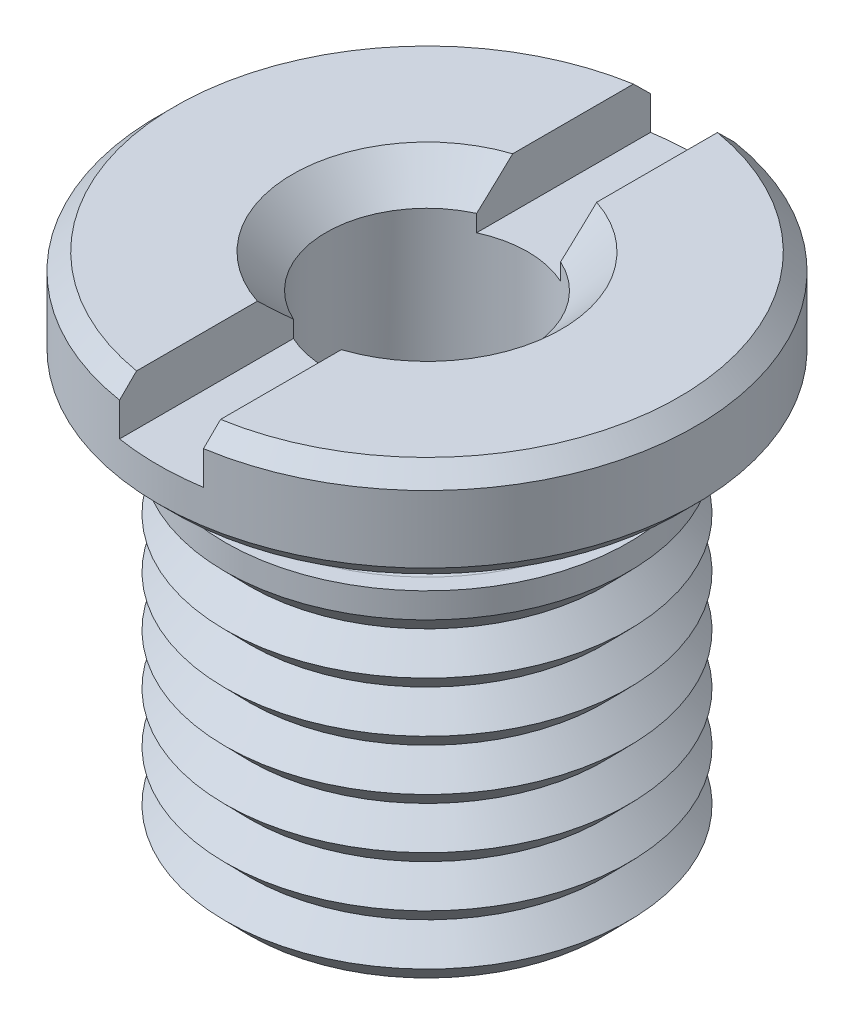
ISO-10303-21;
HEADER;
FILE_DESCRIPTION(('STEP AP214'),'2;1');
FILE_NAME('part.step','',(''),(''),'','','');
FILE_SCHEMA(('AUTOMOTIVE_DESIGN { 1 0 10303 214 1 1 1 1 }'));
ENDSEC;
DATA;
#1=APPLICATION_CONTEXT('core data for automotive mechanical design processes');
#2=APPLICATION_PROTOCOL_DEFINITION('international standard','automotive_design',2000,#1);
#3=PRODUCT_CONTEXT('',#1,'mechanical');
#4=PRODUCT('Part','Part','',(#3));
#5=PRODUCT_RELATED_PRODUCT_CATEGORY('part','',(#4));
#6=PRODUCT_DEFINITION_FORMATION('','',#4);
#7=PRODUCT_DEFINITION_CONTEXT('part definition',#1,'design');
#8=PRODUCT_DEFINITION('design','',#6,#7);
#9=PRODUCT_DEFINITION_SHAPE('','',#8);
#10=(LENGTH_UNIT() NAMED_UNIT(*) SI_UNIT(.MILLI.,.METRE.));
#11=(NAMED_UNIT(*) PLANE_ANGLE_UNIT() SI_UNIT($,.RADIAN.));
#12=(NAMED_UNIT(*) SI_UNIT($,.STERADIAN.) SOLID_ANGLE_UNIT());
#13=UNCERTAINTY_MEASURE_WITH_UNIT(LENGTH_MEASURE(1.E-05),#10,'distance_accuracy_value','');
#14=(GEOMETRIC_REPRESENTATION_CONTEXT(3) GLOBAL_UNCERTAINTY_ASSIGNED_CONTEXT((#13)) GLOBAL_UNIT_ASSIGNED_CONTEXT((#10,
#11,#12)) REPRESENTATION_CONTEXT('',''));
#15=CARTESIAN_POINT('',(0.,0.,0.));
#16=DIRECTION('',(0.,0.,1.));
#17=DIRECTION('',(1.,0.,0.));
#18=AXIS2_PLACEMENT_3D('',#15,#16,#17);
#19=CARTESIAN_POINT('',(0.,-9.02081528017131,0.));
#20=DIRECTION('',(0.,1.,0.));
#21=DIRECTION('',(0.,0.,1.));
#22=AXIS2_PLACEMENT_3D('',#19,#20,#21);
#23=CYLINDRICAL_SURFACE('',#22,4.25);
#24=CARTESIAN_POINT('',(0.,9.,0.));
#25=DIRECTION('',(0.,-1.,0.));
#26=DIRECTION('',(0.,0.,-1.));
#27=AXIS2_PLACEMENT_3D('',#24,#25,#26);
#28=CIRCLE('',#27,4.25);
#29=CARTESIAN_POINT('',(0.,9.,-4.25));
#30=VERTEX_POINT('',#29);
#31=EDGE_CURVE('E57',#30,#30,#28,.T.);
#32=ORIENTED_EDGE('',*,*,#31,.T.);
#33=EDGE_LOOP('',(#32));
#34=FACE_BOUND('',#33,.T.);
#35=CARTESIAN_POINT('',(0.,3.,0.));
#36=DIRECTION('',(0.,-1.,0.));
#37=DIRECTION('',(0.,0.,-1.));
#38=AXIS2_PLACEMENT_3D('',#35,#36,#37);
#39=CIRCLE('',#38,4.25);
#40=CARTESIAN_POINT('',(0.,3.,-4.25));
#41=VERTEX_POINT('',#40);
#42=EDGE_CURVE('E12',#41,#41,#39,.T.);
#43=ORIENTED_EDGE('',*,*,#42,.F.);
#44=EDGE_LOOP('',(#43));
#45=FACE_BOUND('',#44,.T.);
#46=ADVANCED_FACE('F49',(#34,#45),#23,.T.);
#47=CARTESIAN_POINT('',(0.,9.,0.));
#48=DIRECTION('',(0.,-1.,0.));
#49=DIRECTION('',(0.,0.,-1.));
#50=AXIS2_PLACEMENT_3D('',#47,#48,#49);
#51=PLANE('',#50);
#52=ORIENTED_EDGE('',*,*,#31,.F.);
#53=EDGE_LOOP('',(#52));
#54=FACE_BOUND('',#53,.T.);
#55=ADVANCED_FACE('F66',(#54),#51,.F.);
#56=CARTESIAN_POINT('',(0.,3.,0.));
#57=DIRECTION('',(0.,-1.,0.));
#58=DIRECTION('',(0.,0.,-1.));
#59=AXIS2_PLACEMENT_3D('',#56,#57,#58);
#60=PLANE('',#59);
#61=ORIENTED_EDGE('',*,*,#42,.T.);
#62=EDGE_LOOP('',(#61));
#63=FACE_BOUND('',#62,.T.);
#64=ADVANCED_FACE('F51',(#63),#60,.T.);
#65=CLOSED_SHELL('',(#46,#55,#64));
#66=MANIFOLD_SOLID_BREP('B2',#65);
#67=CARTESIAN_POINT('',(0.,2.5,0.));
#68=DIRECTION('',(0.,-1.,0.));
#69=DIRECTION('',(0.,0.,-1.));
#70=AXIS2_PLACEMENT_3D('',#67,#68,#69);
#71=PLANE('',#70);
#72=CARTESIAN_POINT('',(0.,2.5,0.));
#73=DIRECTION('',(0.,-1.,0.));
#74=DIRECTION('',(0.,0.,-1.));
#75=AXIS2_PLACEMENT_3D('',#72,#73,#74);
#76=CIRCLE('',#75,4.5);
#77=CARTESIAN_POINT('',(0.,2.5,-4.5));
#78=VERTEX_POINT('',#77);
#79=EDGE_CURVE('E48',#78,#78,#76,.T.);
#80=ORIENTED_EDGE('',*,*,#79,.T.);
#81=EDGE_LOOP('',(#80));
#82=FACE_BOUND('',#81,.T.);
#83=CARTESIAN_POINT('',(0.,2.5,0.));
#84=DIRECTION('',(0.,-1.,0.));
#85=DIRECTION('',(1.,0.,0.));
#86=AXIS2_PLACEMENT_3D('',#83,#84,#85);
#87=CIRCLE('',#86,3.5);
#88=CARTESIAN_POINT('',(3.5,2.5,0.));
#89=VERTEX_POINT('',#88);
#90=EDGE_CURVE('E117',#89,#89,#87,.T.);
#91=ORIENTED_EDGE('',*,*,#90,.F.);
#92=EDGE_LOOP('',(#91));
#93=FACE_BOUND('',#92,.T.);
#94=ADVANCED_FACE('F103',(#82,#93),#71,.T.);
#95=CARTESIAN_POINT('',(0.,3.,0.));
#96=DIRECTION('',(0.,-1.,0.));
#97=DIRECTION('',(0.,0.,-1.));
#98=AXIS2_PLACEMENT_3D('',#95,#96,#97);
#99=PLANE('',#98);
#100=CARTESIAN_POINT('',(0.,3.,0.));
#101=DIRECTION('',(0.,-1.,0.));
#102=DIRECTION('',(0.,0.,-1.));
#103=AXIS2_PLACEMENT_3D('',#100,#101,#102);
#104=CIRCLE('',#103,4.5);
#105=CARTESIAN_POINT('',(0.,3.,-4.5));
#106=VERTEX_POINT('',#105);
#107=EDGE_CURVE('E107',#106,#106,#104,.T.);
#108=ORIENTED_EDGE('',*,*,#107,.F.);
#109=EDGE_LOOP('',(#108));
#110=FACE_BOUND('',#109,.T.);
#111=CARTESIAN_POINT('',(0.,3.,0.));
#112=DIRECTION('',(0.,-1.,0.));
#113=DIRECTION('',(1.,0.,0.));
#114=AXIS2_PLACEMENT_3D('',#111,#112,#113);
#115=CIRCLE('',#114,3.5);
#116=CARTESIAN_POINT('',(3.5,3.,0.));
#117=VERTEX_POINT('',#116);
#118=EDGE_CURVE('E119',#117,#117,#115,.T.);
#119=ORIENTED_EDGE('',*,*,#118,.T.);
#120=EDGE_LOOP('',(#119));
#121=FACE_BOUND('',#120,.T.);
#122=ADVANCED_FACE('F130',(#110,#121),#99,.F.);
#123=CARTESIAN_POINT('',(0.,2.5,0.));
#124=DIRECTION('',(0.,1.,0.));
#125=DIRECTION('',(0.,0.,1.));
#126=AXIS2_PLACEMENT_3D('',#123,#124,#125);
#127=CYLINDRICAL_SURFACE('',#126,4.5);
#128=ORIENTED_EDGE('',*,*,#79,.F.);
#129=EDGE_LOOP('',(#128));
#130=FACE_BOUND('',#129,.T.);
#131=ORIENTED_EDGE('',*,*,#107,.T.);
#132=EDGE_LOOP('',(#131));
#133=FACE_BOUND('',#132,.T.);
#134=ADVANCED_FACE('F105',(#130,#133),#127,.T.);
#135=CARTESIAN_POINT('',(0.,2.5,0.));
#136=DIRECTION('',(0.,1.,0.));
#137=DIRECTION('',(0.,0.,1.));
#138=AXIS2_PLACEMENT_3D('',#135,#136,#137);
#139=CYLINDRICAL_SURFACE('',#138,3.5);
#140=ORIENTED_EDGE('',*,*,#90,.T.);
#141=EDGE_LOOP('',(#140));
#142=FACE_BOUND('',#141,.T.);
#143=ORIENTED_EDGE('',*,*,#118,.F.);
#144=EDGE_LOOP('',(#143));
#145=FACE_BOUND('',#144,.T.);
#146=ADVANCED_FACE('F126',(#142,#145),#139,.F.);
#147=CLOSED_SHELL('',(#94,#122,#134,#146));
#148=MANIFOLD_SOLID_BREP('B7',#147);
#149=CARTESIAN_POINT('',(0.,14.5,0.));
#150=DIRECTION('',(0.,-1.,0.));
#151=DIRECTION('',(0.,0.,-1.));
#152=AXIS2_PLACEMENT_3D('',#149,#150,#151);
#153=CONICAL_SURFACE('',#152,8.,0.78539816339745);
#154=CARTESIAN_POINT('',(1.25,4.89511364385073,17.5604533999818));
#155=CARTESIAN_POINT('',(1.25,5.50319474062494,16.9508212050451));
#156=CARTESIAN_POINT('',(1.25,6.11120763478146,16.3411209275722));
#157=CARTESIAN_POINT('',(1.25,7.32702488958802,15.1214785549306));
#158=CARTESIAN_POINT('',(1.25,7.93482924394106,14.5115364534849));
#159=CARTESIAN_POINT('',(1.25,9.15051579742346,13.2909447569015));
#160=CARTESIAN_POINT('',(1.25,9.75839779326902,12.680294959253));
#161=CARTESIAN_POINT('',(1.25,10.9736618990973,11.4585311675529));
#162=CARTESIAN_POINT('',(1.25,11.5810440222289,10.847417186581));
#163=CARTESIAN_POINT('',(1.25,12.792268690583,9.62720680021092));
#164=CARTESIAN_POINT('',(1.25,13.3961147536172,9.0181138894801));
#165=CARTESIAN_POINT('',(1.25,14.3008626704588,8.10341366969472));
#166=CARTESIAN_POINT('',(1.25,14.602287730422,7.79832397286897));
#167=CARTESIAN_POINT('',(1.25,15.2046364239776,7.18765459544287));
#168=CARTESIAN_POINT('',(1.25,15.5055600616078,6.88207491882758));
#169=CARTESIAN_POINT('',(1.25,16.1065548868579,6.27031901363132));
#170=CARTESIAN_POINT('',(1.25,16.4066263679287,5.96414307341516));
#171=CARTESIAN_POINT('',(1.25,17.005653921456,5.35068118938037));
#172=CARTESIAN_POINT('',(1.25,17.304609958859,5.04339521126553));
#173=CARTESIAN_POINT('',(1.25,17.7515852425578,4.58109789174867));
#174=CARTESIAN_POINT('',(1.25,17.9003232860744,4.42678181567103));
#175=CARTESIAN_POINT('',(1.25,18.1971433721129,4.11752037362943));
#176=CARTESIAN_POINT('',(1.25,18.3452254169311,3.96257500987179));
#177=CARTESIAN_POINT('',(1.25,18.6404697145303,3.6518246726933));
#178=CARTESIAN_POINT('',(1.25,18.787632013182,3.49601974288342));
#179=CARTESIAN_POINT('',(1.25,19.0806349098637,3.18317307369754));
#180=CARTESIAN_POINT('',(1.25,19.2264755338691,3.02613135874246));
#181=CARTESIAN_POINT('',(1.25,19.4108245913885,2.82503011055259));
#182=CARTESIAN_POINT('',(1.25,19.4502789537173,2.78183756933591));
#183=CARTESIAN_POINT('',(1.25,19.5290112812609,2.69529179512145));
#184=CARTESIAN_POINT('',(1.25,19.5682892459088,2.65193856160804));
#185=CARTESIAN_POINT('',(1.25,19.685826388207,2.52160414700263));
#186=CARTESIAN_POINT('',(1.25,19.7637856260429,2.43435172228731));
#187=CARTESIAN_POINT('',(1.25,19.9187899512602,2.25872855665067));
#188=CARTESIAN_POINT('',(1.25,19.9958329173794,2.17035593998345));
#189=CARTESIAN_POINT('',(1.25,20.1484361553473,1.99235025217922));
#190=CARTESIAN_POINT('',(1.25,20.2239965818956,1.90271731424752));
#191=CARTESIAN_POINT('',(1.25,20.3634134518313,1.73335118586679));
#192=CARTESIAN_POINT('',(1.25,20.4275246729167,1.65382849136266));
#193=CARTESIAN_POINT('',(1.25,20.553458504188,1.49299470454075));
#194=CARTESIAN_POINT('',(1.25,20.6152814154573,1.41168384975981));
#195=CARTESIAN_POINT('',(1.25,20.7354961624,1.24666606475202));
#196=CARTESIAN_POINT('',(1.25,20.7938913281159,1.16296158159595));
#197=CARTESIAN_POINT('',(1.25,20.9054251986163,0.992151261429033));
#198=CARTESIAN_POINT('',(1.25,20.9585687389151,0.905048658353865));
#199=CARTESIAN_POINT('',(1.25,21.0507865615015,0.736300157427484));
#200=CARTESIAN_POINT('',(1.25,21.0907739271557,0.655163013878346));
#201=CARTESIAN_POINT('',(1.25,21.1600904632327,0.488404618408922));
#202=CARTESIAN_POINT('',(1.25,21.1894466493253,0.402795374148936));
#203=CARTESIAN_POINT('',(1.25,21.2196328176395,0.279382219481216));
#204=CARTESIAN_POINT('',(1.25,21.2270735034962,0.243181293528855));
#205=CARTESIAN_POINT('',(1.25,21.2389638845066,0.170299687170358));
#206=CARTESIAN_POINT('',(1.25,21.2434150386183,0.133619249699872));
#207=CARTESIAN_POINT('',(1.25,21.2490949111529,0.0600463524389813));
#208=CARTESIAN_POINT('',(1.25,21.2503272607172,0.0231541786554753));
#209=CARTESIAN_POINT('',(1.25,21.2495222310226,-0.0505870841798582));
#210=CARTESIAN_POINT('',(1.25,21.2474847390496,-0.08743617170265));
#211=CARTESIAN_POINT('',(1.25,21.2366140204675,-0.197234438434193));
#212=CARTESIAN_POINT('',(1.25,21.2230462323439,-0.269757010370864));
#213=CARTESIAN_POINT('',(1.25,21.1950127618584,-0.376421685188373));
#214=CARTESIAN_POINT('',(1.25,21.1843685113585,-0.411669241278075));
#215=CARTESIAN_POINT('',(1.25,21.1608936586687,-0.481433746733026));
#216=CARTESIAN_POINT('',(1.25,21.1480631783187,-0.515950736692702));
#217=CARTESIAN_POINT('',(1.25,21.1144335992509,-0.599451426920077));
#218=CARTESIAN_POINT('',(1.25,21.0926312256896,-0.648028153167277));
#219=CARTESIAN_POINT('',(1.25,21.0460660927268,-0.743752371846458));
#220=CARTESIAN_POINT('',(1.25,21.0213016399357,-0.790899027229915));
#221=CARTESIAN_POINT('',(1.25,20.9435484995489,-0.930636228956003));
#222=CARTESIAN_POINT('',(1.25,20.8871818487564,-1.02133654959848));
#223=CARTESIAN_POINT('',(1.25,20.7685760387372,-1.19991424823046));
#224=CARTESIAN_POINT('',(1.25,20.7062873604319,-1.28775773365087));
#225=CARTESIAN_POINT('',(1.25,20.6102837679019,-1.41751910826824));
#226=CARTESIAN_POINT('',(1.25,20.5778754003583,-1.4604124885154));
#227=CARTESIAN_POINT('',(1.25,20.5123431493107,-1.54564655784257));
#228=CARTESIAN_POINT('',(1.25,20.4792192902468,-1.58798726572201));
#229=CARTESIAN_POINT('',(1.25,20.3693306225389,-1.72647327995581));
#230=CARTESIAN_POINT('',(1.25,20.29133479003,-1.8216410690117));
#231=CARTESIAN_POINT('',(1.25,20.13332745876,-2.01029258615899));
#232=CARTESIAN_POINT('',(1.25,20.0533157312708,-2.10377612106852));
#233=CARTESIAN_POINT('',(1.25,19.8918569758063,-2.28954596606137));
#234=CARTESIAN_POINT('',(1.25,19.8104094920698,-2.38183187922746));
#235=CARTESIAN_POINT('',(1.25,19.6464882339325,-2.56548889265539));
#236=CARTESIAN_POINT('',(1.25,19.5640144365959,-2.65685997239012));
#237=CARTESIAN_POINT('',(1.25,19.3152315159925,-2.93018887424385));
#238=CARTESIAN_POINT('',(1.25,19.147783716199,-3.11110918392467));
#239=CARTESIAN_POINT('',(1.25,18.8111182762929,-3.4712202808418));
#240=CARTESIAN_POINT('',(1.25,18.6419009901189,-3.65041140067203));
#241=CARTESIAN_POINT('',(1.25,18.303456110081,-4.00643340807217));
#242=CARTESIAN_POINT('',(1.25,18.1342366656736,-4.18327204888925));
#243=CARTESIAN_POINT('',(1.25,17.7949879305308,-4.5361870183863));
#244=CARTESIAN_POINT('',(1.25,17.624958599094,-4.71226330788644));
#245=CARTESIAN_POINT('',(1.25,17.2844500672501,-5.0637294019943));
#246=CARTESIAN_POINT('',(1.25,17.1139712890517,-5.2391196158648));
#247=CARTESIAN_POINT('',(1.25,16.7725881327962,-5.58947962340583));
#248=CARTESIAN_POINT('',(1.25,16.601683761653,-5.76444942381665));
#249=CARTESIAN_POINT('',(1.25,15.9558330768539,-6.42446661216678));
#250=CARTESIAN_POINT('',(1.25,15.4798256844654,-6.90847532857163));
#251=CARTESIAN_POINT('',(1.25,14.5265514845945,-7.87525645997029));
#252=CARTESIAN_POINT('',(1.25,14.0492846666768,-8.35802886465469));
#253=CARTESIAN_POINT('',(1.25,13.0938396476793,-9.32297815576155));
#254=CARTESIAN_POINT('',(1.25,12.6156612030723,-9.80515480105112));
#255=CARTESIAN_POINT('',(1.25,11.6588234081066,-10.7690277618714));
#256=CARTESIAN_POINT('',(1.25,11.1801640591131,-11.2507240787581));
#257=CARTESIAN_POINT('',(1.25,10.2178597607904,-12.2184744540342));
#258=CARTESIAN_POINT('',(1.25,9.73421160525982,-12.7045253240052));
#259=CARTESIAN_POINT('',(1.25,8.76667864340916,-13.6763923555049));
#260=CARTESIAN_POINT('',(1.25,8.28279383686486,-14.1622085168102));
#261=CARTESIAN_POINT('',(1.25,7.31501680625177,-15.133503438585));
#262=CARTESIAN_POINT('',(1.25,6.83112464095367,-15.6189822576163));
#263=CARTESIAN_POINT('',(1.25,5.86320831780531,-16.5898072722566));
#264=CARTESIAN_POINT('',(1.25,5.37918416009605,-17.0751534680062));
#265=CARTESIAN_POINT('',(1.25,4.89511364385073,-17.5604533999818));
#266=B_SPLINE_CURVE_WITH_KNOTS('',3,(#154,#155,#156,#157,#158,#159,#160,#161,#162,#163,#164,
#165,#166,#167,#168,#169,#170,#171,#172,#173,#174,#175,#176,#177,#178,#179,#180,#181,#182,#183,
#184,#185,#186,#187,#188,#189,#190,#191,#192,#193,#194,#195,#196,#197,#198,#199,#200,#201,#202,
#203,#204,#205,#206,#207,#208,#209,#210,#211,#212,#213,#214,#215,#216,#217,#218,#219,#220,#221,
#222,#223,#224,#225,#226,#227,#228,#229,#230,#231,#232,#233,#234,#235,#236,#237,#238,#239,#240,
#241,#242,#243,#244,#245,#246,#247,#248,#249,#250,#251,#252,#253,#254,#255,#256,#257,#258,#259,
#260,#261,#262,#263,#264,#265),.UNSPECIFIED.,.F.,.F.,(4,2,2,2,2,2,2,2,2,2,2,2,2,2,2,2,2,2,2,2,2,
2,2,2,2,2,2,2,2,2,2,2,2,2,2,2,2,2,2,2,2,2,2,2,2,2,2,2,2,2,2,2,2,2,2,4),(0.,2.58316212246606,
5.16639637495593,7.75129912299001,10.3361315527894,12.9091862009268,14.1958214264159,
15.4824462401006,16.768555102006,18.0547040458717,18.6976865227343,19.3406667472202,
19.983614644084,20.6265498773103,20.8020492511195,20.9775491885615,21.3285632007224,
21.6802738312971,22.0319475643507,22.3383624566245,22.6447368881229,22.9508085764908,
23.25659576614,23.5275479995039,23.7978067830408,23.9085745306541,24.0192881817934,
24.1298768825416,24.2404693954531,24.460698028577,24.5711090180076,24.6815138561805,
24.8411128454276,25.000803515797,25.3207954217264,25.6437486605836,25.805021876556,
25.9662895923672,26.3353779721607,26.7045084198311,27.0737582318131,27.4430163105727,
28.182544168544,28.9219268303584,29.6562008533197,30.3905121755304,31.124284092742,
31.8580441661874,33.8946107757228,35.9311943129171,37.968432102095,40.0056641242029,
42.0627125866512,44.1197630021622,46.1761121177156,48.2324590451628),.UNSPECIFIED.);
#267=CARTESIAN_POINT('',(1.25,14.5,7.90174031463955));
#268=VERTEX_POINT('',#267);
#269=CARTESIAN_POINT('',(1.25,15.,7.39509972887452));
#270=VERTEX_POINT('',#269);
#271=EDGE_CURVE('E288',#268,#270,#266,.T.);
#272=ORIENTED_EDGE('',*,*,#271,.F.);
#273=CARTESIAN_POINT('',(0.,14.5,0.));
#274=DIRECTION('',(0.,-1.,0.));
#275=DIRECTION('',(0.,0.,-1.));
#276=AXIS2_PLACEMENT_3D('',#273,#274,#275);
#277=CIRCLE('',#276,8.);
#278=CARTESIAN_POINT('',(1.25,14.5,-7.90174031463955));
#279=VERTEX_POINT('',#278);
#280=EDGE_CURVE('E285',#279,#268,#277,.T.);
#281=ORIENTED_EDGE('',*,*,#280,.F.);
#282=CARTESIAN_POINT('',(1.25,15.,-7.39509972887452));
#283=VERTEX_POINT('',#282);
#284=EDGE_CURVE('E299',#283,#279,#266,.T.);
#285=ORIENTED_EDGE('',*,*,#284,.F.);
#286=CARTESIAN_POINT('',(0.,15.,0.));
#287=DIRECTION('',(0.,-1.,0.));
#288=DIRECTION('',(0.,0.,-1.));
#289=AXIS2_PLACEMENT_3D('',#286,#287,#288);
#290=CIRCLE('',#289,7.5);
#291=EDGE_CURVE('E335',#283,#270,#290,.T.);
#292=ORIENTED_EDGE('',*,*,#291,.T.);
#293=EDGE_LOOP('',(#272,#281,#285,#292));
#294=FACE_BOUND('',#293,.T.);
#295=ADVANCED_FACE('F172',(#294),#153,.T.);
#296=CARTESIAN_POINT('',(4.,15.,0.));
#297=DIRECTION('',(0.,1.,0.));
#298=DIRECTION('',(0.,0.,1.));
#299=AXIS2_PLACEMENT_3D('',#296,#297,#298);
#300=PLANE('',#299);
#301=DIRECTION('',(0.,0.,-1.));
#302=VECTOR('',#301,1.);
#303=CARTESIAN_POINT('',(1.25,15.,-8.));
#304=LINE('',#303,#302);
#305=CARTESIAN_POINT('',(1.25,15.,3.79967103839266));
#306=VERTEX_POINT('',#305);
#307=EDGE_CURVE('E413',#270,#306,#304,.T.);
#308=ORIENTED_EDGE('',*,*,#307,.F.);
#309=ORIENTED_EDGE('',*,*,#291,.F.);
#310=CARTESIAN_POINT('',(1.25,15.,-3.79967103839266));
#311=VERTEX_POINT('',#310);
#312=EDGE_CURVE('E411',#311,#283,#304,.T.);
#313=ORIENTED_EDGE('',*,*,#312,.F.);
#314=CARTESIAN_POINT('',(0.,15.,0.));
#315=DIRECTION('',(0.,-1.,0.));
#316=DIRECTION('',(0.,0.,-1.));
#317=AXIS2_PLACEMENT_3D('',#314,#315,#316);
#318=CIRCLE('',#317,4.);
#319=EDGE_CURVE('E330',#311,#306,#318,.T.);
#320=ORIENTED_EDGE('',*,*,#319,.T.);
#321=EDGE_LOOP('',(#308,#309,#313,#320));
#322=FACE_BOUND('',#321,.T.);
#323=ADVANCED_FACE('F504',(#322),#300,.T.);
#324=CARTESIAN_POINT('',(0.,15.,0.));
#325=DIRECTION('',(0.,1.,0.));
#326=DIRECTION('',(0.,0.,1.));
#327=AXIS2_PLACEMENT_3D('',#324,#325,#326);
#328=CONICAL_SURFACE('',#327,4.,0.785398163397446);
#329=CARTESIAN_POINT('',(1.25,19.8375546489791,8.74870688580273));
#330=CARTESIAN_POINT('',(1.25,19.5796581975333,8.48817881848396));
#331=CARTESIAN_POINT('',(1.25,19.3218661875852,8.22754711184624));
#332=CARTESIAN_POINT('',(1.25,18.8064761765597,7.70585891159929));
#333=CARTESIAN_POINT('',(1.25,18.5488783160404,7.4448022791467));
#334=CARTESIAN_POINT('',(1.25,18.0318725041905,6.92002610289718));
#335=CARTESIAN_POINT('',(1.25,17.7724681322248,6.65630303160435));
#336=CARTESIAN_POINT('',(1.25,17.2543678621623,6.12839313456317));
#337=CARTESIAN_POINT('',(1.25,16.995671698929,5.86420656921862));
#338=CARTESIAN_POINT('',(1.25,16.5639192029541,5.421825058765));
#339=CARTESIAN_POINT('',(1.25,16.3906220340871,5.2438652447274));
#340=CARTESIAN_POINT('',(1.25,16.0445543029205,4.88741824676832));
#341=CARTESIAN_POINT('',(1.25,15.8717837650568,4.70893103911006));
#342=CARTESIAN_POINT('',(1.25,15.5267155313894,4.35096901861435));
#343=CARTESIAN_POINT('',(1.25,15.3544189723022,4.17149310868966));
#344=CARTESIAN_POINT('',(1.25,15.0109248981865,3.81155005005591));
#345=CARTESIAN_POINT('',(1.25,14.8397272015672,3.63108307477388));
#346=CARTESIAN_POINT('',(1.25,14.5000733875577,3.26983513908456));
#347=CARTESIAN_POINT('',(1.25,14.3316066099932,3.08906424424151));
#348=CARTESIAN_POINT('',(1.25,14.0808059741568,2.81604979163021));
#349=CARTESIAN_POINT('',(1.25,13.9974949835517,2.72470462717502));
#350=CARTESIAN_POINT('',(1.25,13.8317450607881,2.5412273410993));
#351=CARTESIAN_POINT('',(1.25,13.7493061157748,2.44909523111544));
#352=CARTESIAN_POINT('',(1.25,13.585836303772,2.26405070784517));
#353=CARTESIAN_POINT('',(1.25,13.5048021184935,2.1711412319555));
#354=CARTESIAN_POINT('',(1.25,13.3443755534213,1.98391882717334));
#355=CARTESIAN_POINT('',(1.25,13.2649830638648,1.88960599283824));
#356=CARTESIAN_POINT('',(1.25,13.1086736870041,1.69910873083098));
#357=CARTESIAN_POINT('',(1.25,13.0317543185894,1.60292634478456));
#358=CARTESIAN_POINT('',(1.25,12.8815804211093,1.40775277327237));
#359=CARTESIAN_POINT('',(1.25,12.8083243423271,1.30876280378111));
#360=CARTESIAN_POINT('',(1.25,12.7191864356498,1.18045563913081));
#361=CARTESIAN_POINT('',(1.25,12.7004981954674,1.15308738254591));
#362=CARTESIAN_POINT('',(1.25,12.663636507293,1.09800175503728));
#363=CARTESIAN_POINT('',(1.25,12.6454631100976,1.07028435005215));
#364=CARTESIAN_POINT('',(1.25,12.6097097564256,1.01445793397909));
#365=CARTESIAN_POINT('',(1.25,12.5921299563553,0.986348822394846));
#366=CARTESIAN_POINT('',(1.25,12.5576730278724,0.929704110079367));
#367=CARTESIAN_POINT('',(1.25,12.5407958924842,0.901168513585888));
#368=CARTESIAN_POINT('',(1.25,12.4916560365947,0.815313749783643));
#369=CARTESIAN_POINT('',(1.25,12.4605924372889,0.757296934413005));
#370=CARTESIAN_POINT('',(1.25,12.4029424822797,0.639067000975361));
#371=CARTESIAN_POINT('',(1.25,12.3763535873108,0.5788551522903));
#372=CARTESIAN_POINT('',(1.25,12.3387771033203,0.480603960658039));
#373=CARTESIAN_POINT('',(1.25,12.3258026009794,0.443326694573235));
#374=CARTESIAN_POINT('',(1.25,12.3025341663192,0.367940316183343));
#375=CARTESIAN_POINT('',(1.25,12.2922397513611,0.329831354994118));
#376=CARTESIAN_POINT('',(1.25,12.2748065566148,0.253029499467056));
#377=CARTESIAN_POINT('',(1.25,12.2676567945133,0.214339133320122));
#378=CARTESIAN_POINT('',(1.25,12.2568375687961,0.1364767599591));
#379=CARTESIAN_POINT('',(1.25,12.2531672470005,0.097304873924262));
#380=CARTESIAN_POINT('',(1.25,12.2495133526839,0.0184977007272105));
#381=CARTESIAN_POINT('',(1.25,12.2495569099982,-0.0211388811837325));
#382=CARTESIAN_POINT('',(1.25,12.2533870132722,-0.100221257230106));
#383=CARTESIAN_POINT('',(1.25,12.2571736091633,-0.139667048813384));
#384=CARTESIAN_POINT('',(1.25,12.2738738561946,-0.257432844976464));
#385=CARTESIAN_POINT('',(1.25,12.2921340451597,-0.335022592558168));
#386=CARTESIAN_POINT('',(1.25,12.3345638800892,-0.471040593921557));
#387=CARTESIAN_POINT('',(1.25,12.3567528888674,-0.530134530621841));
#388=CARTESIAN_POINT('',(1.25,12.4061776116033,-0.64620935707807));
#389=CARTESIAN_POINT('',(1.25,12.4334175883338,-0.703188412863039));
#390=CARTESIAN_POINT('',(1.25,12.4917083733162,-0.815482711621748));
#391=CARTESIAN_POINT('',(1.25,12.5227772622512,-0.870788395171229));
#392=CARTESIAN_POINT('',(1.25,12.5876072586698,-0.979749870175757));
#393=CARTESIAN_POINT('',(1.25,12.6213671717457,-1.03340637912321));
#394=CARTESIAN_POINT('',(1.25,12.6975456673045,-1.14953706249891));
#395=CARTESIAN_POINT('',(1.25,12.740384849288,-1.2117335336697));
#396=CARTESIAN_POINT('',(1.25,12.8281124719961,-1.33467042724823));
#397=CARTESIAN_POINT('',(1.25,12.873001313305,-1.39541056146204));
#398=CARTESIAN_POINT('',(1.25,12.9643216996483,-1.51578299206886));
#399=CARTESIAN_POINT('',(1.25,13.0107543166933,-1.57541447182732));
#400=CARTESIAN_POINT('',(1.25,13.1047697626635,-1.69376561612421));
#401=CARTESIAN_POINT('',(1.25,13.1523526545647,-1.75248523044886));
#402=CARTESIAN_POINT('',(1.25,13.296648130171,-1.92783429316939));
#403=CARTESIAN_POINT('',(1.25,13.3946879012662,-2.04337004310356));
#404=CARTESIAN_POINT('',(1.25,13.5929389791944,-2.2724638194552));
#405=CARTESIAN_POINT('',(1.25,13.6931493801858,-2.38602263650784));
#406=CARTESIAN_POINT('',(1.25,13.8953754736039,-2.61213803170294));
#407=CARTESIAN_POINT('',(1.25,13.9973957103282,-2.72469053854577));
#408=CARTESIAN_POINT('',(1.25,14.2025107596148,-2.94883043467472));
#409=CARTESIAN_POINT('',(1.25,14.3056056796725,-3.06041772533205));
#410=CARTESIAN_POINT('',(1.25,14.6157303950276,-3.39377632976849));
#411=CARTESIAN_POINT('',(1.25,14.8239051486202,-3.61448142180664));
#412=CARTESIAN_POINT('',(1.25,15.2316566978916,-4.04333135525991));
#413=CARTESIAN_POINT('',(1.25,15.4311488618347,-4.25155703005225));
#414=CARTESIAN_POINT('',(1.25,15.8311809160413,-4.66700523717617));
#415=CARTESIAN_POINT('',(1.25,16.0317208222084,-4.8742277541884));
#416=CARTESIAN_POINT('',(1.25,16.634624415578,-5.49512603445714));
#417=CARTESIAN_POINT('',(1.25,17.0380345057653,-5.90778464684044));
#418=CARTESIAN_POINT('',(1.25,17.8404681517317,-6.72573573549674));
#419=CARTESIAN_POINT('',(1.25,18.2394709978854,-7.13104857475));
#420=CARTESIAN_POINT('',(1.25,18.8384914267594,-7.73825115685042));
#421=CARTESIAN_POINT('',(1.25,19.0381864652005,-7.94045916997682));
#422=CARTESIAN_POINT('',(1.25,19.4377502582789,-8.3447025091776));
#423=CARTESIAN_POINT('',(1.25,19.6376190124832,-8.54673783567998));
#424=CARTESIAN_POINT('',(1.25,19.8375546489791,-8.74870688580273));
#425=B_SPLINE_CURVE_WITH_KNOTS('',3,(#329,#330,#331,#332,#333,#334,#335,#336,#337,#338,#339,
#340,#341,#342,#343,#344,#345,#346,#347,#348,#349,#350,#351,#352,#353,#354,#355,#356,#357,#358,
#359,#360,#361,#362,#363,#364,#365,#366,#367,#368,#369,#370,#371,#372,#373,#374,#375,#376,#377,
#378,#379,#380,#381,#382,#383,#384,#385,#386,#387,#388,#389,#390,#391,#392,#393,#394,#395,#396,
#397,#398,#399,#400,#401,#402,#403,#404,#405,#406,#407,#408,#409,#410,#411,#412,#413,#414,#415,
#416,#417,#418,#419,#420,#421,#422,#423,#424),.UNSPECIFIED.,.F.,.F.,(4,2,2,2,2,2,2,2,2,2,2,2,2,
2,2,2,2,2,2,2,2,2,2,2,2,2,2,2,2,2,2,2,2,2,2,2,2,2,2,2,2,2,2,2,2,2,2,4),(0.,1.09975889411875,
2.20001538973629,3.30977350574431,4.41903490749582,5.16422832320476,5.90945580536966,
6.65583004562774,7.40207759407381,8.14336345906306,8.51425295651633,8.88513697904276,
9.25497389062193,9.62478599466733,9.99421471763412,10.3634858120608,10.4629016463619,
10.5623272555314,10.6617788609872,10.7612294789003,10.9585236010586,11.155705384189,
11.2740358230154,11.3923449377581,11.5102375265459,11.6281010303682,11.7468255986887,
11.8655517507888,12.1034730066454,12.292588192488,12.4818637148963,12.6720699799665,
12.8621922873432,13.0887000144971,13.3152522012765,13.5419651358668,13.7686905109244,
14.223217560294,14.6775584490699,15.1332738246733,15.589035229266,16.4991944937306,
17.3642894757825,18.2293976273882,19.9606437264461,21.666906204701,22.5194878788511,
23.3720674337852),.UNSPECIFIED.);
#426=CARTESIAN_POINT('',(1.25,14.,2.72717802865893));
#427=VERTEX_POINT('',#426);
#428=EDGE_CURVE('E460',#306,#427,#425,.T.);
#429=ORIENTED_EDGE('',*,*,#428,.F.);
#430=ORIENTED_EDGE('',*,*,#319,.F.);
#431=CARTESIAN_POINT('',(1.25,14.,-2.72717802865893));
#432=VERTEX_POINT('',#431);
#433=EDGE_CURVE('E451',#432,#311,#425,.T.);
#434=ORIENTED_EDGE('',*,*,#433,.F.);
#435=CARTESIAN_POINT('',(0.,14.,0.));
#436=DIRECTION('',(0.,-1.,0.));
#437=DIRECTION('',(0.,0.,-1.));
#438=AXIS2_PLACEMENT_3D('',#435,#436,#437);
#439=CIRCLE('',#438,3.);
#440=EDGE_CURVE('E325',#432,#427,#439,.T.);
#441=ORIENTED_EDGE('',*,*,#440,.T.);
#442=EDGE_LOOP('',(#429,#430,#434,#441));
#443=FACE_BOUND('',#442,.T.);
#444=ADVANCED_FACE('F499',(#443),#328,.F.);
#445=CARTESIAN_POINT('',(6.,0.,0.));
#446=DIRECTION('',(0.,-1.,0.));
#447=DIRECTION('',(0.,0.,-1.));
#448=AXIS2_PLACEMENT_3D('',#445,#446,#447);
#449=PLANE('',#448);
#450=CARTESIAN_POINT('',(0.,0.,0.));
#451=DIRECTION('',(0.,-1.,0.));
#452=DIRECTION('',(0.,0.,-1.));
#453=AXIS2_PLACEMENT_3D('',#450,#451,#452);
#454=CIRCLE('',#453,5.26515307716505);
#455=CARTESIAN_POINT('',(0.,0.,-5.26515307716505));
#456=VERTEX_POINT('',#455);
#457=EDGE_CURVE('E407',#456,#456,#454,.T.);
#458=ORIENTED_EDGE('',*,*,#457,.T.);
#459=EDGE_LOOP('',(#458));
#460=FACE_BOUND('',#459,.T.);
#461=CARTESIAN_POINT('',(0.,0.,0.));
#462=DIRECTION('',(0.,-1.,0.));
#463=DIRECTION('',(0.,0.,-1.));
#464=AXIS2_PLACEMENT_3D('',#461,#462,#463);
#465=CIRCLE('',#464,4.25);
#466=CARTESIAN_POINT('',(0.,0.,-4.25));
#467=VERTEX_POINT('',#466);
#468=EDGE_CURVE('E287',#467,#467,#465,.T.);
#469=ORIENTED_EDGE('',*,*,#468,.F.);
#470=EDGE_LOOP('',(#469));
#471=FACE_BOUND('',#470,.T.);
#472=ADVANCED_FACE('F174',(#460,#471),#449,.T.);
#473=CARTESIAN_POINT('',(0.,0.,0.));
#474=DIRECTION('',(0.,-1.,0.));
#475=DIRECTION('',(0.,0.,-1.));
#476=AXIS2_PLACEMENT_3D('',#473,#474,#475);
#477=CYLINDRICAL_SURFACE('',#476,6.);
#478=CARTESIAN_POINT('',(0.,9.75,0.));
#479=DIRECTION('',(0.,-1.,0.));
#480=DIRECTION('',(0.,0.,-1.));
#481=AXIS2_PLACEMENT_3D('',#478,#479,#480);
#482=CIRCLE('',#481,6.);
#483=CARTESIAN_POINT('',(0.,9.75,-6.));
#484=VERTEX_POINT('',#483);
#485=EDGE_CURVE('E523',#484,#484,#482,.T.);
#486=ORIENTED_EDGE('',*,*,#485,.F.);
#487=EDGE_LOOP('',(#486));
#488=FACE_BOUND('',#487,.T.);
#489=CARTESIAN_POINT('',(0.,10.5,0.));
#490=DIRECTION('',(0.,-1.,0.));
#491=DIRECTION('',(0.,0.,-1.));
#492=AXIS2_PLACEMENT_3D('',#489,#490,#491);
#493=CIRCLE('',#492,6.);
#494=CARTESIAN_POINT('',(0.,10.5,-6.));
#495=VERTEX_POINT('',#494);
#496=EDGE_CURVE('E367',#495,#495,#493,.T.);
#497=ORIENTED_EDGE('',*,*,#496,.T.);
#498=EDGE_LOOP('',(#497));
#499=FACE_BOUND('',#498,.T.);
#500=ADVANCED_FACE('F492',(#488,#499),#477,.T.);
#501=CARTESIAN_POINT('',(5.5,10.5,0.));
#502=DIRECTION('',(0.,1.,0.));
#503=DIRECTION('',(0.,0.,1.));
#504=AXIS2_PLACEMENT_3D('',#501,#502,#503);
#505=PLANE('',#504);
#506=CARTESIAN_POINT('',(0.,10.5,0.));
#507=DIRECTION('',(0.,-1.,0.));
#508=DIRECTION('',(0.,0.,-1.));
#509=AXIS2_PLACEMENT_3D('',#506,#507,#508);
#510=CIRCLE('',#509,5.5);
#511=CARTESIAN_POINT('',(0.,10.5,-5.5));
#512=VERTEX_POINT('',#511);
#513=EDGE_CURVE('E363',#512,#512,#510,.T.);
#514=ORIENTED_EDGE('',*,*,#513,.T.);
#515=EDGE_LOOP('',(#514));
#516=FACE_BOUND('',#515,.T.);
#517=ORIENTED_EDGE('',*,*,#496,.F.);
#518=EDGE_LOOP('',(#517));
#519=FACE_BOUND('',#518,.T.);
#520=ADVANCED_FACE('F489',(#516,#519),#505,.T.);
#521=CARTESIAN_POINT('',(0.,11.,0.));
#522=DIRECTION('',(0.,-1.,0.));
#523=DIRECTION('',(0.,0.,-1.));
#524=AXIS2_PLACEMENT_3D('',#521,#522,#523);
#525=TOROIDAL_SURFACE('',#524,5.5,0.5);
#526=CARTESIAN_POINT('',(0.,11.,0.));
#527=DIRECTION('',(0.,-1.,0.));
#528=DIRECTION('',(0.,0.,-1.));
#529=AXIS2_PLACEMENT_3D('',#526,#527,#528);
#530=CIRCLE('',#529,5.);
#531=CARTESIAN_POINT('',(0.,11.,-5.));
#532=VERTEX_POINT('',#531);
#533=EDGE_CURVE('E359',#532,#532,#530,.T.);
#534=ORIENTED_EDGE('',*,*,#533,.T.);
#535=EDGE_LOOP('',(#534));
#536=FACE_BOUND('',#535,.T.);
#537=ORIENTED_EDGE('',*,*,#513,.F.);
#538=EDGE_LOOP('',(#537));
#539=FACE_BOUND('',#538,.T.);
#540=ADVANCED_FACE('F485',(#536,#539),#525,.F.);
#541=CARTESIAN_POINT('',(0.,0.,0.));
#542=DIRECTION('',(0.,-1.,0.));
#543=DIRECTION('',(0.,0.,-1.));
#544=AXIS2_PLACEMENT_3D('',#541,#542,#543);
#545=CYLINDRICAL_SURFACE('',#544,5.);
#546=CARTESIAN_POINT('',(0.,11.5,0.));
#547=DIRECTION('',(0.,-1.,0.));
#548=DIRECTION('',(0.,0.,-1.));
#549=AXIS2_PLACEMENT_3D('',#546,#547,#548);
#550=CIRCLE('',#549,5.);
#551=CARTESIAN_POINT('',(0.,11.5,-5.));
#552=VERTEX_POINT('',#551);
#553=EDGE_CURVE('E355',#552,#552,#550,.T.);
#554=ORIENTED_EDGE('',*,*,#553,.T.);
#555=EDGE_LOOP('',(#554));
#556=FACE_BOUND('',#555,.T.);
#557=ORIENTED_EDGE('',*,*,#533,.F.);
#558=EDGE_LOOP('',(#557));
#559=FACE_BOUND('',#558,.T.);
#560=ADVANCED_FACE('F481',(#556,#559),#545,.T.);
#561=CARTESIAN_POINT('',(0.,11.5,0.));
#562=DIRECTION('',(0.,-1.,0.));
#563=DIRECTION('',(0.,0.,-1.));
#564=AXIS2_PLACEMENT_3D('',#561,#562,#563);
#565=TOROIDAL_SURFACE('',#564,5.5,0.5);
#566=CARTESIAN_POINT('',(0.,12.,0.));
#567=DIRECTION('',(0.,-1.,0.));
#568=DIRECTION('',(0.,0.,-1.));
#569=AXIS2_PLACEMENT_3D('',#566,#567,#568);
#570=CIRCLE('',#569,5.5);
#571=CARTESIAN_POINT('',(0.,12.,-5.5));
#572=VERTEX_POINT('',#571);
#573=EDGE_CURVE('E351',#572,#572,#570,.T.);
#574=ORIENTED_EDGE('',*,*,#573,.T.);
#575=EDGE_LOOP('',(#574));
#576=FACE_BOUND('',#575,.T.);
#577=ORIENTED_EDGE('',*,*,#553,.F.);
#578=EDGE_LOOP('',(#577));
#579=FACE_BOUND('',#578,.T.);
#580=ADVANCED_FACE('F477',(#576,#579),#565,.F.);
#581=CARTESIAN_POINT('',(7.5,12.,0.));
#582=DIRECTION('',(0.,-1.,0.));
#583=DIRECTION('',(0.,0.,-1.));
#584=AXIS2_PLACEMENT_3D('',#581,#582,#583);
#585=PLANE('',#584);
#586=CARTESIAN_POINT('',(0.,12.,0.));
#587=DIRECTION('',(0.,-1.,0.));
#588=DIRECTION('',(0.,0.,-1.));
#589=AXIS2_PLACEMENT_3D('',#586,#587,#588);
#590=CIRCLE('',#589,7.5);
#591=CARTESIAN_POINT('',(0.,12.,-7.5));
#592=VERTEX_POINT('',#591);
#593=EDGE_CURVE('E347',#592,#592,#590,.T.);
#594=ORIENTED_EDGE('',*,*,#593,.T.);
#595=EDGE_LOOP('',(#594));
#596=FACE_BOUND('',#595,.T.);
#597=ORIENTED_EDGE('',*,*,#573,.F.);
#598=EDGE_LOOP('',(#597));
#599=FACE_BOUND('',#598,.T.);
#600=ADVANCED_FACE('F473',(#596,#599),#585,.T.);
#601=CARTESIAN_POINT('',(0.,12.,0.));
#602=DIRECTION('',(0.,1.,0.));
#603=DIRECTION('',(0.,0.,1.));
#604=AXIS2_PLACEMENT_3D('',#601,#602,#603);
#605=CONICAL_SURFACE('',#604,7.5,0.785398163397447);
#606=CARTESIAN_POINT('',(0.,12.5,0.));
#607=DIRECTION('',(0.,-1.,0.));
#608=DIRECTION('',(0.,0.,-1.));
#609=AXIS2_PLACEMENT_3D('',#606,#607,#608);
#610=CIRCLE('',#609,8.);
#611=CARTESIAN_POINT('',(0.,12.5,-8.));
#612=VERTEX_POINT('',#611);
#613=EDGE_CURVE('E343',#612,#612,#610,.T.);
#614=ORIENTED_EDGE('',*,*,#613,.T.);
#615=EDGE_LOOP('',(#614));
#616=FACE_BOUND('',#615,.T.);
#617=ORIENTED_EDGE('',*,*,#593,.F.);
#618=EDGE_LOOP('',(#617));
#619=FACE_BOUND('',#618,.T.);
#620=ADVANCED_FACE('F470',(#616,#619),#605,.T.);
#621=CARTESIAN_POINT('',(0.,0.,0.));
#622=DIRECTION('',(0.,-1.,0.));
#623=DIRECTION('',(0.,0.,-1.));
#624=AXIS2_PLACEMENT_3D('',#621,#622,#623);
#625=CYLINDRICAL_SURFACE('',#624,8.);
#626=DIRECTION('',(0.,-1.,0.));
#627=VECTOR('',#626,1.);
#628=CARTESIAN_POINT('',(1.25,0.,-7.90174031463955));
#629=LINE('',#628,#627);
#630=CARTESIAN_POINT('',(1.25,13.5,-7.90174031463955));
#631=VERTEX_POINT('',#630);
#632=EDGE_CURVE('E297',#279,#631,#629,.T.);
#633=ORIENTED_EDGE('',*,*,#632,.F.);
#634=ORIENTED_EDGE('',*,*,#280,.T.);
#635=DIRECTION('',(0.,-1.,0.));
#636=VECTOR('',#635,1.);
#637=CARTESIAN_POINT('',(1.25,0.,7.90174031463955));
#638=LINE('',#637,#636);
#639=CARTESIAN_POINT('',(1.25,13.5,7.90174031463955));
#640=VERTEX_POINT('',#639);
#641=EDGE_CURVE('E272',#640,#268,#638,.F.);
#642=ORIENTED_EDGE('',*,*,#641,.F.);
#643=CARTESIAN_POINT('',(0.,13.5,0.));
#644=DIRECTION('',(0.,1.,0.));
#645=DIRECTION('',(0.,0.,1.));
#646=AXIS2_PLACEMENT_3D('',#643,#644,#645);
#647=CIRCLE('',#646,8.);
#648=CARTESIAN_POINT('',(-1.25,13.5,7.90174031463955));
#649=VERTEX_POINT('',#648);
#650=EDGE_CURVE('E259',#640,#649,#647,.F.);
#651=ORIENTED_EDGE('',*,*,#650,.T.);
#652=DIRECTION('',(0.,-1.,0.));
#653=VECTOR('',#652,1.);
#654=CARTESIAN_POINT('',(-1.25,0.,7.90174031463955));
#655=LINE('',#654,#653);
#656=CARTESIAN_POINT('',(-1.25,14.5,7.90174031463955));
#657=VERTEX_POINT('',#656);
#658=EDGE_CURVE('E666',#657,#649,#655,.T.);
#659=ORIENTED_EDGE('',*,*,#658,.F.);
#660=CARTESIAN_POINT('',(-1.25,14.5,-7.90174031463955));
#661=VERTEX_POINT('',#660);
#662=EDGE_CURVE('E339',#657,#661,#277,.T.);
#663=ORIENTED_EDGE('',*,*,#662,.T.);
#664=DIRECTION('',(0.,-1.,0.));
#665=VECTOR('',#664,1.);
#666=CARTESIAN_POINT('',(-1.25,0.,-7.90174031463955));
#667=LINE('',#666,#665);
#668=CARTESIAN_POINT('',(-1.25,13.5,-7.90174031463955));
#669=VERTEX_POINT('',#668);
#670=EDGE_CURVE('E528',#669,#661,#667,.F.);
#671=ORIENTED_EDGE('',*,*,#670,.F.);
#672=EDGE_CURVE('E268',#669,#631,#647,.F.);
#673=ORIENTED_EDGE('',*,*,#672,.T.);
#674=EDGE_LOOP('',(#633,#634,#642,#651,#659,#663,#671,#673));
#675=FACE_BOUND('',#674,.T.);
#676=ORIENTED_EDGE('',*,*,#613,.F.);
#677=EDGE_LOOP('',(#676));
#678=FACE_BOUND('',#677,.T.);
#679=ADVANCED_FACE('F282',(#675,#678),#625,.T.);
#680=CARTESIAN_POINT('',(-1.25,4.89511364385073,-17.5604533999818));
#681=CARTESIAN_POINT('',(-1.25,5.50319474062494,-16.9508212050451));
#682=CARTESIAN_POINT('',(-1.25,6.11120763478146,-16.3411209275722));
#683=CARTESIAN_POINT('',(-1.25,7.32702488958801,-15.1214785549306));
#684=CARTESIAN_POINT('',(-1.25,7.93482924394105,-14.5115364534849));
#685=CARTESIAN_POINT('',(-1.25,9.15051579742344,-13.2909447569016));
#686=CARTESIAN_POINT('',(-1.25,9.758397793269,-12.6802949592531));
#687=CARTESIAN_POINT('',(-1.25,10.9736618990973,-11.458531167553));
#688=CARTESIAN_POINT('',(-1.25,11.5810440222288,-10.847417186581));
#689=CARTESIAN_POINT('',(-1.25,12.7922686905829,-9.62720680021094));
#690=CARTESIAN_POINT('',(-1.25,13.3961147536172,-9.01811388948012));
#691=CARTESIAN_POINT('',(-1.25,14.3008626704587,-8.10341366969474));
#692=CARTESIAN_POINT('',(-1.25,14.602287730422,-7.79832397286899));
#693=CARTESIAN_POINT('',(-1.25,15.2046364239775,-7.18765459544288));
#694=CARTESIAN_POINT('',(-1.25,15.5055600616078,-6.88207491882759));
#695=CARTESIAN_POINT('',(-1.25,16.1065548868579,-6.27031901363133));
#696=CARTESIAN_POINT('',(-1.25,16.4066263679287,-5.96414307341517));
#697=CARTESIAN_POINT('',(-1.25,17.0056539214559,-5.35068118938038));
#698=CARTESIAN_POINT('',(-1.25,17.304609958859,-5.04339521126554));
#699=CARTESIAN_POINT('',(-1.25,17.7515852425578,-4.58109789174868));
#700=CARTESIAN_POINT('',(-1.25,17.9003232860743,-4.42678181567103));
#701=CARTESIAN_POINT('',(-1.25,18.1971433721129,-4.11752037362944));
#702=CARTESIAN_POINT('',(-1.25,18.3452254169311,-3.96257500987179));
#703=CARTESIAN_POINT('',(-1.25,18.6404697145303,-3.65182467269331));
#704=CARTESIAN_POINT('',(-1.25,18.787632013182,-3.49601974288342));
#705=CARTESIAN_POINT('',(-1.25,19.0806349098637,-3.18317307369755));
#706=CARTESIAN_POINT('',(-1.25,19.2264755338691,-3.02613135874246));
#707=CARTESIAN_POINT('',(-1.25,19.4108245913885,-2.8250301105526));
#708=CARTESIAN_POINT('',(-1.25,19.4502789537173,-2.78183756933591));
#709=CARTESIAN_POINT('',(-1.25,19.5290112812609,-2.69529179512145));
#710=CARTESIAN_POINT('',(-1.25,19.5682892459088,-2.65193856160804));
#711=CARTESIAN_POINT('',(-1.25,19.685826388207,-2.52160414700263));
#712=CARTESIAN_POINT('',(-1.25,19.7637856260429,-2.43435172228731));
#713=CARTESIAN_POINT('',(-1.25,19.9187899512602,-2.25872855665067));
#714=CARTESIAN_POINT('',(-1.25,19.9958329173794,-2.17035593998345));
#715=CARTESIAN_POINT('',(-1.25,20.1484361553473,-1.99235025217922));
#716=CARTESIAN_POINT('',(-1.25,20.2239965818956,-1.90271731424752));
#717=CARTESIAN_POINT('',(-1.25,20.3634134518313,-1.7333511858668));
#718=CARTESIAN_POINT('',(-1.25,20.4275246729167,-1.65382849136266));
#719=CARTESIAN_POINT('',(-1.25,20.553458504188,-1.49299470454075));
#720=CARTESIAN_POINT('',(-1.25,20.6152814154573,-1.41168384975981));
#721=CARTESIAN_POINT('',(-1.25,20.7354961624,-1.24666606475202));
#722=CARTESIAN_POINT('',(-1.25,20.7938913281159,-1.16296158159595));
#723=CARTESIAN_POINT('',(-1.25,20.9054251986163,-0.992151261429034));
#724=CARTESIAN_POINT('',(-1.25,20.9585687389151,-0.905048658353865));
#725=CARTESIAN_POINT('',(-1.25,21.0507865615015,-0.736300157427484));
#726=CARTESIAN_POINT('',(-1.25,21.0907739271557,-0.655163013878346));
#727=CARTESIAN_POINT('',(-1.25,21.1600904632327,-0.488404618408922));
#728=CARTESIAN_POINT('',(-1.25,21.1894466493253,-0.402795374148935));
#729=CARTESIAN_POINT('',(-1.25,21.2196328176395,-0.279382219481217));
#730=CARTESIAN_POINT('',(-1.25,21.2270735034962,-0.243181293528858));
#731=CARTESIAN_POINT('',(-1.25,21.2389638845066,-0.170299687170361));
#732=CARTESIAN_POINT('',(-1.25,21.2434150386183,-0.133619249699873));
#733=CARTESIAN_POINT('',(-1.25,21.2490949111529,-0.0600463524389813));
#734=CARTESIAN_POINT('',(-1.25,21.2503272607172,-0.0231541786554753));
#735=CARTESIAN_POINT('',(-1.25,21.2495222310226,0.0505870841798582));
#736=CARTESIAN_POINT('',(-1.25,21.2474847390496,0.08743617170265));
#737=CARTESIAN_POINT('',(-1.25,21.2366140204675,0.197234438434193));
#738=CARTESIAN_POINT('',(-1.25,21.2230462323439,0.269757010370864));
#739=CARTESIAN_POINT('',(-1.25,21.1950127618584,0.376421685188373));
#740=CARTESIAN_POINT('',(-1.25,21.1843685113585,0.411669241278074));
#741=CARTESIAN_POINT('',(-1.25,21.1608936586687,0.481433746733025));
#742=CARTESIAN_POINT('',(-1.25,21.1480631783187,0.515950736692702));
#743=CARTESIAN_POINT('',(-1.25,21.1144335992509,0.599451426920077));
#744=CARTESIAN_POINT('',(-1.25,21.0926312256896,0.648028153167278));
#745=CARTESIAN_POINT('',(-1.25,21.0460660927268,0.74375237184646));
#746=CARTESIAN_POINT('',(-1.25,21.0213016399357,0.790899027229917));
#747=CARTESIAN_POINT('',(-1.25,20.9435484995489,0.930636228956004));
#748=CARTESIAN_POINT('',(-1.25,20.8871818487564,1.02133654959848));
#749=CARTESIAN_POINT('',(-1.25,20.7685760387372,1.19991424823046));
#750=CARTESIAN_POINT('',(-1.25,20.7062873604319,1.28775773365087));
#751=CARTESIAN_POINT('',(-1.25,20.6102837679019,1.41751910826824));
#752=CARTESIAN_POINT('',(-1.25,20.5778754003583,1.4604124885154));
#753=CARTESIAN_POINT('',(-1.25,20.5123431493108,1.54564655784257));
#754=CARTESIAN_POINT('',(-1.25,20.4792192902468,1.58798726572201));
#755=CARTESIAN_POINT('',(-1.25,20.3693306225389,1.7264732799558));
#756=CARTESIAN_POINT('',(-1.25,20.29133479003,1.8216410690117));
#757=CARTESIAN_POINT('',(-1.25,20.13332745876,2.01029258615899));
#758=CARTESIAN_POINT('',(-1.25,20.0533157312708,2.10377612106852));
#759=CARTESIAN_POINT('',(-1.25,19.8918569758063,2.28954596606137));
#760=CARTESIAN_POINT('',(-1.25,19.8104094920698,2.38183187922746));
#761=CARTESIAN_POINT('',(-1.25,19.6464882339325,2.56548889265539));
#762=CARTESIAN_POINT('',(-1.25,19.5640144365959,2.65685997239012));
#763=CARTESIAN_POINT('',(-1.25,19.3152315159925,2.93018887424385));
#764=CARTESIAN_POINT('',(-1.25,19.147783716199,3.11110918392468));
#765=CARTESIAN_POINT('',(-1.25,18.8111182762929,3.4712202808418));
#766=CARTESIAN_POINT('',(-1.25,18.6419009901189,3.65041140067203));
#767=CARTESIAN_POINT('',(-1.25,18.303456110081,4.00643340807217));
#768=CARTESIAN_POINT('',(-1.25,18.1342366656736,4.18327204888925));
#769=CARTESIAN_POINT('',(-1.25,17.7949879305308,4.5361870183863));
#770=CARTESIAN_POINT('',(-1.25,17.624958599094,4.71226330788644));
#771=CARTESIAN_POINT('',(-1.25,17.2844500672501,5.0637294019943));
#772=CARTESIAN_POINT('',(-1.25,17.1139712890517,5.2391196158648));
#773=CARTESIAN_POINT('',(-1.25,16.7725881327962,5.58947962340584));
#774=CARTESIAN_POINT('',(-1.25,16.601683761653,5.76444942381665));
#775=CARTESIAN_POINT('',(-1.25,15.9558330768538,6.42446661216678));
#776=CARTESIAN_POINT('',(-1.25,15.4798256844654,6.90847532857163));
#777=CARTESIAN_POINT('',(-1.25,14.5265514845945,7.87525645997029));
#778=CARTESIAN_POINT('',(-1.25,14.0492846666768,8.3580288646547));
#779=CARTESIAN_POINT('',(-1.25,13.0938396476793,9.32297815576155));
#780=CARTESIAN_POINT('',(-1.25,12.6156612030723,9.80515480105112));
#781=CARTESIAN_POINT('',(-1.25,11.6588234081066,10.7690277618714));
#782=CARTESIAN_POINT('',(-1.25,11.1801640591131,11.2507240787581));
#783=CARTESIAN_POINT('',(-1.25,10.2178597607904,12.2184744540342));
#784=CARTESIAN_POINT('',(-1.25,9.73421160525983,12.7045253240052));
#785=CARTESIAN_POINT('',(-1.25,8.76667864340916,13.6763923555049));
#786=CARTESIAN_POINT('',(-1.25,8.28279383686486,14.1622085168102));
#787=CARTESIAN_POINT('',(-1.25,7.31501680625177,15.133503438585));
#788=CARTESIAN_POINT('',(-1.25,6.83112464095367,15.6189822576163));
#789=CARTESIAN_POINT('',(-1.25,5.86320831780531,16.5898072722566));
#790=CARTESIAN_POINT('',(-1.25,5.37918416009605,17.0751534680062));
#791=CARTESIAN_POINT('',(-1.25,4.89511364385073,17.5604533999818));
#792=B_SPLINE_CURVE_WITH_KNOTS('',3,(#680,#681,#682,#683,#684,#685,#686,#687,#688,#689,#690,
#691,#692,#693,#694,#695,#696,#697,#698,#699,#700,#701,#702,#703,#704,#705,#706,#707,#708,#709,
#710,#711,#712,#713,#714,#715,#716,#717,#718,#719,#720,#721,#722,#723,#724,#725,#726,#727,#728,
#729,#730,#731,#732,#733,#734,#735,#736,#737,#738,#739,#740,#741,#742,#743,#744,#745,#746,#747,
#748,#749,#750,#751,#752,#753,#754,#755,#756,#757,#758,#759,#760,#761,#762,#763,#764,#765,#766,
#767,#768,#769,#770,#771,#772,#773,#774,#775,#776,#777,#778,#779,#780,#781,#782,#783,#784,#785,
#786,#787,#788,#789,#790,#791),.UNSPECIFIED.,.F.,.F.,(4,2,2,2,2,2,2,2,2,2,2,2,2,2,2,2,2,2,2,2,2,
2,2,2,2,2,2,2,2,2,2,2,2,2,2,2,2,2,2,2,2,2,2,2,2,2,2,2,2,2,2,2,2,2,2,4),(0.,2.58316212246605,
5.16639637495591,7.75129912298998,10.3361315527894,12.9091862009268,14.1958214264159,
15.4824462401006,16.768555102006,18.0547040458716,18.6976865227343,19.3406667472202,
19.983614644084,20.6265498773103,20.8020492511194,20.9775491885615,21.3285632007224,
21.6802738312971,22.0319475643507,22.3383624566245,22.6447368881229,22.9508085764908,
23.25659576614,23.5275479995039,23.7978067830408,23.9085745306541,24.0192881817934,
24.1298768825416,24.2404693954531,24.460698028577,24.5711090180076,24.6815138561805,
24.8411128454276,25.000803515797,25.3207954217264,25.6437486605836,25.805021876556,
25.9662895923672,26.3353779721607,26.7045084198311,27.0737582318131,27.4430163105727,
28.182544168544,28.9219268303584,29.6562008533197,30.3905121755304,31.124284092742,
31.8580441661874,33.8946107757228,35.9311943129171,37.968432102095,40.0056641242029,
42.0627125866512,44.1197630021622,46.1761121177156,48.2324590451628),.UNSPECIFIED.);
#793=CARTESIAN_POINT('',(-1.25,15.,-7.39509972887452));
#794=VERTEX_POINT('',#793);
#795=EDGE_CURVE('E530',#661,#794,#792,.T.);
#796=ORIENTED_EDGE('',*,*,#795,.F.);
#797=ORIENTED_EDGE('',*,*,#662,.F.);
#798=CARTESIAN_POINT('',(-1.25,15.,7.39509972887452));
#799=VERTEX_POINT('',#798);
#800=EDGE_CURVE('E424',#799,#657,#792,.T.);
#801=ORIENTED_EDGE('',*,*,#800,.F.);
#802=EDGE_CURVE('E334',#799,#794,#290,.T.);
#803=ORIENTED_EDGE('',*,*,#802,.T.);
#804=EDGE_LOOP('',(#796,#797,#801,#803));
#805=FACE_BOUND('',#804,.T.);
#806=ADVANCED_FACE('F461',(#805),#153,.T.);
#807=DIRECTION('',(0.,0.,1.));
#808=VECTOR('',#807,1.);
#809=CARTESIAN_POINT('',(-1.25,15.,-8.));
#810=LINE('',#809,#808);
#811=CARTESIAN_POINT('',(-1.25,15.,-3.79967103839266));
#812=VERTEX_POINT('',#811);
#813=EDGE_CURVE('E402',#794,#812,#810,.T.);
#814=ORIENTED_EDGE('',*,*,#813,.F.);
#815=ORIENTED_EDGE('',*,*,#802,.F.);
#816=CARTESIAN_POINT('',(-1.25,15.,3.79967103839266));
#817=VERTEX_POINT('',#816);
#818=EDGE_CURVE('E403',#817,#799,#810,.T.);
#819=ORIENTED_EDGE('',*,*,#818,.F.);
#820=EDGE_CURVE('E329',#817,#812,#318,.T.);
#821=ORIENTED_EDGE('',*,*,#820,.T.);
#822=EDGE_LOOP('',(#814,#815,#819,#821));
#823=FACE_BOUND('',#822,.T.);
#824=ADVANCED_FACE('F465',(#823),#300,.T.);
#825=CARTESIAN_POINT('',(-1.25,19.8375546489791,-8.74870688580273));
#826=CARTESIAN_POINT('',(-1.25,19.5796581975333,-8.48817881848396));
#827=CARTESIAN_POINT('',(-1.25,19.3218661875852,-8.22754711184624));
#828=CARTESIAN_POINT('',(-1.25,18.8064761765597,-7.70585891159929));
#829=CARTESIAN_POINT('',(-1.25,18.5488783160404,-7.4448022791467));
#830=CARTESIAN_POINT('',(-1.25,18.0318725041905,-6.92002610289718));
#831=CARTESIAN_POINT('',(-1.25,17.7724681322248,-6.65630303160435));
#832=CARTESIAN_POINT('',(-1.25,17.2543678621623,-6.12839313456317));
#833=CARTESIAN_POINT('',(-1.25,16.995671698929,-5.86420656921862));
#834=CARTESIAN_POINT('',(-1.25,16.5639192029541,-5.421825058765));
#835=CARTESIAN_POINT('',(-1.25,16.3906220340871,-5.2438652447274));
#836=CARTESIAN_POINT('',(-1.25,16.0445543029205,-4.88741824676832));
#837=CARTESIAN_POINT('',(-1.25,15.8717837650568,-4.70893103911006));
#838=CARTESIAN_POINT('',(-1.25,15.5267155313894,-4.35096901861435));
#839=CARTESIAN_POINT('',(-1.25,15.3544189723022,-4.17149310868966));
#840=CARTESIAN_POINT('',(-1.25,15.0109248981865,-3.81155005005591));
#841=CARTESIAN_POINT('',(-1.25,14.8397272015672,-3.63108307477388));
#842=CARTESIAN_POINT('',(-1.25,14.5000733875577,-3.26983513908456));
#843=CARTESIAN_POINT('',(-1.25,14.3316066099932,-3.08906424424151));
#844=CARTESIAN_POINT('',(-1.25,14.0808059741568,-2.81604979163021));
#845=CARTESIAN_POINT('',(-1.25,13.9974949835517,-2.72470462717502));
#846=CARTESIAN_POINT('',(-1.25,13.8317450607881,-2.5412273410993));
#847=CARTESIAN_POINT('',(-1.25,13.7493061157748,-2.44909523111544));
#848=CARTESIAN_POINT('',(-1.25,13.585836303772,-2.26405070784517));
#849=CARTESIAN_POINT('',(-1.25,13.5048021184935,-2.1711412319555));
#850=CARTESIAN_POINT('',(-1.25,13.3443755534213,-1.98391882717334));
#851=CARTESIAN_POINT('',(-1.25,13.2649830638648,-1.88960599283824));
#852=CARTESIAN_POINT('',(-1.25,13.1086736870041,-1.69910873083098));
#853=CARTESIAN_POINT('',(-1.25,13.0317543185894,-1.60292634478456));
#854=CARTESIAN_POINT('',(-1.25,12.8815804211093,-1.40775277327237));
#855=CARTESIAN_POINT('',(-1.25,12.8083243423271,-1.30876280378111));
#856=CARTESIAN_POINT('',(-1.25,12.7191864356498,-1.18045563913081));
#857=CARTESIAN_POINT('',(-1.25,12.7004981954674,-1.15308738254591));
#858=CARTESIAN_POINT('',(-1.25,12.663636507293,-1.09800175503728));
#859=CARTESIAN_POINT('',(-1.25,12.6454631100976,-1.07028435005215));
#860=CARTESIAN_POINT('',(-1.25,12.6097097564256,-1.01445793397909));
#861=CARTESIAN_POINT('',(-1.25,12.5921299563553,-0.986348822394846));
#862=CARTESIAN_POINT('',(-1.25,12.5576730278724,-0.929704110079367));
#863=CARTESIAN_POINT('',(-1.25,12.5407958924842,-0.901168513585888));
#864=CARTESIAN_POINT('',(-1.25,12.4916560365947,-0.815313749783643));
#865=CARTESIAN_POINT('',(-1.25,12.4605924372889,-0.757296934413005));
#866=CARTESIAN_POINT('',(-1.25,12.4029424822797,-0.639067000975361));
#867=CARTESIAN_POINT('',(-1.25,12.3763535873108,-0.5788551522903));
#868=CARTESIAN_POINT('',(-1.25,12.3387771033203,-0.480603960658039));
#869=CARTESIAN_POINT('',(-1.25,12.3258026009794,-0.443326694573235));
#870=CARTESIAN_POINT('',(-1.25,12.3025341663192,-0.367940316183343));
#871=CARTESIAN_POINT('',(-1.25,12.2922397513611,-0.329831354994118));
#872=CARTESIAN_POINT('',(-1.25,12.2748065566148,-0.253029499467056));
#873=CARTESIAN_POINT('',(-1.25,12.2676567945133,-0.214339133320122));
#874=CARTESIAN_POINT('',(-1.25,12.2568375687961,-0.1364767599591));
#875=CARTESIAN_POINT('',(-1.25,12.2531672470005,-0.097304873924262));
#876=CARTESIAN_POINT('',(-1.25,12.2495133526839,-0.0184977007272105));
#877=CARTESIAN_POINT('',(-1.25,12.2495569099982,0.0211388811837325));
#878=CARTESIAN_POINT('',(-1.25,12.2533870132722,0.100221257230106));
#879=CARTESIAN_POINT('',(-1.25,12.2571736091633,0.139667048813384));
#880=CARTESIAN_POINT('',(-1.25,12.2738738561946,0.257432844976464));
#881=CARTESIAN_POINT('',(-1.25,12.2921340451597,0.335022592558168));
#882=CARTESIAN_POINT('',(-1.25,12.3345638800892,0.471040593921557));
#883=CARTESIAN_POINT('',(-1.25,12.3567528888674,0.530134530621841));
#884=CARTESIAN_POINT('',(-1.25,12.4061776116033,0.64620935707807));
#885=CARTESIAN_POINT('',(-1.25,12.4334175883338,0.703188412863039));
#886=CARTESIAN_POINT('',(-1.25,12.4917083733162,0.815482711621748));
#887=CARTESIAN_POINT('',(-1.25,12.5227772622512,0.870788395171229));
#888=CARTESIAN_POINT('',(-1.25,12.5876072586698,0.979749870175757));
#889=CARTESIAN_POINT('',(-1.25,12.6213671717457,1.03340637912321));
#890=CARTESIAN_POINT('',(-1.25,12.6975456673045,1.14953706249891));
#891=CARTESIAN_POINT('',(-1.25,12.740384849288,1.2117335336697));
#892=CARTESIAN_POINT('',(-1.25,12.8281124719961,1.33467042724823));
#893=CARTESIAN_POINT('',(-1.25,12.873001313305,1.39541056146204));
#894=CARTESIAN_POINT('',(-1.25,12.9643216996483,1.51578299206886));
#895=CARTESIAN_POINT('',(-1.25,13.0107543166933,1.57541447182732));
#896=CARTESIAN_POINT('',(-1.25,13.1047697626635,1.69376561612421));
#897=CARTESIAN_POINT('',(-1.25,13.1523526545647,1.75248523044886));
#898=CARTESIAN_POINT('',(-1.25,13.296648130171,1.92783429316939));
#899=CARTESIAN_POINT('',(-1.25,13.3946879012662,2.04337004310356));
#900=CARTESIAN_POINT('',(-1.25,13.5929389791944,2.2724638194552));
#901=CARTESIAN_POINT('',(-1.25,13.6931493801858,2.38602263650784));
#902=CARTESIAN_POINT('',(-1.25,13.8953754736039,2.61213803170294));
#903=CARTESIAN_POINT('',(-1.25,13.9973957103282,2.72469053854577));
#904=CARTESIAN_POINT('',(-1.25,14.2025107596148,2.94883043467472));
#905=CARTESIAN_POINT('',(-1.25,14.3056056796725,3.06041772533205));
#906=CARTESIAN_POINT('',(-1.25,14.6157303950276,3.39377632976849));
#907=CARTESIAN_POINT('',(-1.25,14.8239051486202,3.61448142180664));
#908=CARTESIAN_POINT('',(-1.25,15.2316566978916,4.04333135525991));
#909=CARTESIAN_POINT('',(-1.25,15.4311488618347,4.25155703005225));
#910=CARTESIAN_POINT('',(-1.25,15.8311809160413,4.66700523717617));
#911=CARTESIAN_POINT('',(-1.25,16.0317208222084,4.8742277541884));
#912=CARTESIAN_POINT('',(-1.25,16.634624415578,5.49512603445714));
#913=CARTESIAN_POINT('',(-1.25,17.0380345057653,5.90778464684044));
#914=CARTESIAN_POINT('',(-1.25,17.8404681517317,6.72573573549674));
#915=CARTESIAN_POINT('',(-1.25,18.2394709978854,7.13104857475));
#916=CARTESIAN_POINT('',(-1.25,18.8384914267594,7.73825115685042));
#917=CARTESIAN_POINT('',(-1.25,19.0381864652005,7.94045916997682));
#918=CARTESIAN_POINT('',(-1.25,19.4377502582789,8.3447025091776));
#919=CARTESIAN_POINT('',(-1.25,19.6376190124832,8.54673783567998));
#920=CARTESIAN_POINT('',(-1.25,19.8375546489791,8.74870688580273));
#921=B_SPLINE_CURVE_WITH_KNOTS('',3,(#825,#826,#827,#828,#829,#830,#831,#832,#833,#834,#835,
#836,#837,#838,#839,#840,#841,#842,#843,#844,#845,#846,#847,#848,#849,#850,#851,#852,#853,#854,
#855,#856,#857,#858,#859,#860,#861,#862,#863,#864,#865,#866,#867,#868,#869,#870,#871,#872,#873,
#874,#875,#876,#877,#878,#879,#880,#881,#882,#883,#884,#885,#886,#887,#888,#889,#890,#891,#892,
#893,#894,#895,#896,#897,#898,#899,#900,#901,#902,#903,#904,#905,#906,#907,#908,#909,#910,#911,
#912,#913,#914,#915,#916,#917,#918,#919,#920),.UNSPECIFIED.,.F.,.F.,(4,2,2,2,2,2,2,2,2,2,2,2,2,
2,2,2,2,2,2,2,2,2,2,2,2,2,2,2,2,2,2,2,2,2,2,2,2,2,2,2,2,2,2,2,2,2,2,4),(0.,1.09975889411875,
2.20001538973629,3.30977350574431,4.41903490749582,5.16422832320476,5.90945580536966,
6.65583004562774,7.40207759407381,8.14336345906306,8.51425295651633,8.88513697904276,
9.25497389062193,9.62478599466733,9.99421471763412,10.3634858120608,10.4629016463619,
10.5623272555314,10.6617788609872,10.7612294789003,10.9585236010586,11.155705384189,
11.2740358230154,11.3923449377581,11.5102375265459,11.6281010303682,11.7468255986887,
11.8655517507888,12.1034730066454,12.292588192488,12.4818637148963,12.6720699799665,
12.8621922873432,13.0887000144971,13.3152522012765,13.5419651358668,13.7686905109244,
14.223217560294,14.6775584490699,15.1332738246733,15.589035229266,16.4991944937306,
17.3642894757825,18.2293976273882,19.9606437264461,21.666906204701,22.5194878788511,
23.3720674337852),.UNSPECIFIED.);
#922=CARTESIAN_POINT('',(-1.25,14.,-2.72717802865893));
#923=VERTEX_POINT('',#922);
#924=EDGE_CURVE('E423',#812,#923,#921,.T.);
#925=ORIENTED_EDGE('',*,*,#924,.F.);
#926=ORIENTED_EDGE('',*,*,#820,.F.);
#927=CARTESIAN_POINT('',(-1.25,14.,2.72717802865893));
#928=VERTEX_POINT('',#927);
#929=EDGE_CURVE('E416',#928,#817,#921,.T.);
#930=ORIENTED_EDGE('',*,*,#929,.F.);
#931=EDGE_CURVE('E324',#928,#923,#439,.T.);
#932=ORIENTED_EDGE('',*,*,#931,.T.);
#933=EDGE_LOOP('',(#925,#926,#930,#932));
#934=FACE_BOUND('',#933,.T.);
#935=ADVANCED_FACE('F430',(#934),#328,.F.);
#936=CARTESIAN_POINT('',(0.,0.,0.));
#937=DIRECTION('',(0.,-1.,0.));
#938=DIRECTION('',(0.,0.,-1.));
#939=AXIS2_PLACEMENT_3D('',#936,#937,#938);
#940=CYLINDRICAL_SURFACE('',#939,3.);
#941=DIRECTION('',(0.,-1.,0.));
#942=VECTOR('',#941,1.);
#943=CARTESIAN_POINT('',(1.25,0.,-2.72717802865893));
#944=LINE('',#943,#942);
#945=CARTESIAN_POINT('',(1.25,13.5,-2.72717802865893));
#946=VERTEX_POINT('',#945);
#947=EDGE_CURVE('E101',#946,#432,#944,.F.);
#948=ORIENTED_EDGE('',*,*,#947,.F.);
#949=CARTESIAN_POINT('',(0.,13.5,0.));
#950=DIRECTION('',(0.,1.,0.));
#951=DIRECTION('',(0.,0.,1.));
#952=AXIS2_PLACEMENT_3D('',#949,#950,#951);
#953=CIRCLE('',#952,3.);
#954=CARTESIAN_POINT('',(-1.25,13.5,-2.72717802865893));
#955=VERTEX_POINT('',#954);
#956=EDGE_CURVE('E375',#946,#955,#953,.T.);
#957=ORIENTED_EDGE('',*,*,#956,.T.);
#958=DIRECTION('',(0.,-1.,0.));
#959=VECTOR('',#958,1.);
#960=CARTESIAN_POINT('',(-1.25,0.,-2.72717802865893));
#961=LINE('',#960,#959);
#962=EDGE_CURVE('E181',#923,#955,#961,.T.);
#963=ORIENTED_EDGE('',*,*,#962,.F.);
#964=ORIENTED_EDGE('',*,*,#931,.F.);
#965=DIRECTION('',(0.,-1.,0.));
#966=VECTOR('',#965,1.);
#967=CARTESIAN_POINT('',(-1.25,0.,2.72717802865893));
#968=LINE('',#967,#966);
#969=CARTESIAN_POINT('',(-1.25,13.5,2.72717802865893));
#970=VERTEX_POINT('',#969);
#971=EDGE_CURVE('E374',#970,#928,#968,.F.);
#972=ORIENTED_EDGE('',*,*,#971,.F.);
#973=CARTESIAN_POINT('',(1.25,13.5,2.72717802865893));
#974=VERTEX_POINT('',#973);
#975=EDGE_CURVE('E371',#970,#974,#953,.T.);
#976=ORIENTED_EDGE('',*,*,#975,.T.);
#977=DIRECTION('',(0.,-1.,0.));
#978=VECTOR('',#977,1.);
#979=CARTESIAN_POINT('',(1.25,0.,2.72717802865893));
#980=LINE('',#979,#978);
#981=EDGE_CURVE('E275',#427,#974,#980,.T.);
#982=ORIENTED_EDGE('',*,*,#981,.F.);
#983=ORIENTED_EDGE('',*,*,#440,.F.);
#984=EDGE_LOOP('',(#948,#957,#963,#964,#972,#976,#982,#983));
#985=FACE_BOUND('',#984,.T.);
#986=CARTESIAN_POINT('',(0.,9.,0.));
#987=DIRECTION('',(0.,-1.,0.));
#988=DIRECTION('',(0.,0.,-1.));
#989=AXIS2_PLACEMENT_3D('',#986,#987,#988);
#990=CIRCLE('',#989,3.);
#991=CARTESIAN_POINT('',(0.,9.,-3.));
#992=VERTEX_POINT('',#991);
#993=EDGE_CURVE('E320',#992,#992,#990,.T.);
#994=ORIENTED_EDGE('',*,*,#993,.T.);
#995=EDGE_LOOP('',(#994));
#996=FACE_BOUND('',#995,.T.);
#997=ADVANCED_FACE('F389',(#985,#996),#940,.F.);
#998=CARTESIAN_POINT('',(4.25,9.,0.));
#999=DIRECTION('',(0.,-1.,0.));
#1000=DIRECTION('',(0.,0.,-1.));
#1001=AXIS2_PLACEMENT_3D('',#998,#999,#1000);
#1002=PLANE('',#1001);
#1003=CARTESIAN_POINT('',(0.,9.,0.));
#1004=DIRECTION('',(0.,-1.,0.));
#1005=DIRECTION('',(0.,0.,-1.));
#1006=AXIS2_PLACEMENT_3D('',#1003,#1004,#1005);
#1007=CIRCLE('',#1006,4.25);
#1008=CARTESIAN_POINT('',(0.,9.,-4.25));
#1009=VERTEX_POINT('',#1008);
#1010=EDGE_CURVE('E316',#1009,#1009,#1007,.T.);
#1011=ORIENTED_EDGE('',*,*,#1010,.T.);
#1012=EDGE_LOOP('',(#1011));
#1013=FACE_BOUND('',#1012,.T.);
#1014=ORIENTED_EDGE('',*,*,#993,.F.);
#1015=EDGE_LOOP('',(#1014));
#1016=FACE_BOUND('',#1015,.T.);
#1017=ADVANCED_FACE('F654',(#1013,#1016),#1002,.T.);
#1018=CARTESIAN_POINT('',(0.,0.,0.));
#1019=DIRECTION('',(0.,-1.,0.));
#1020=DIRECTION('',(0.,0.,-1.));
#1021=AXIS2_PLACEMENT_3D('',#1018,#1019,#1020);
#1022=CYLINDRICAL_SURFACE('',#1021,4.25);
#1023=CARTESIAN_POINT('',(0.,3.,0.));
#1024=DIRECTION('',(0.,-1.,0.));
#1025=DIRECTION('',(0.,0.,-1.));
#1026=AXIS2_PLACEMENT_3D('',#1023,#1024,#1025);
#1027=CIRCLE('',#1026,4.25);
#1028=CARTESIAN_POINT('',(0.,3.,-4.25));
#1029=VERTEX_POINT('',#1028);
#1030=EDGE_CURVE('E312',#1029,#1029,#1027,.T.);
#1031=ORIENTED_EDGE('',*,*,#1030,.T.);
#1032=EDGE_LOOP('',(#1031));
#1033=FACE_BOUND('',#1032,.T.);
#1034=ORIENTED_EDGE('',*,*,#1010,.F.);
#1035=EDGE_LOOP('',(#1034));
#1036=FACE_BOUND('',#1035,.T.);
#1037=ADVANCED_FACE('F714',(#1033,#1036),#1022,.F.);
#1038=CARTESIAN_POINT('',(4.5,3.,0.));
#1039=DIRECTION('',(0.,-1.,0.));
#1040=DIRECTION('',(0.,0.,-1.));
#1041=AXIS2_PLACEMENT_3D('',#1038,#1039,#1040);
#1042=PLANE('',#1041);
#1043=CARTESIAN_POINT('',(0.,3.,0.));
#1044=DIRECTION('',(0.,-1.,0.));
#1045=DIRECTION('',(0.,0.,-1.));
#1046=AXIS2_PLACEMENT_3D('',#1043,#1044,#1045);
#1047=CIRCLE('',#1046,4.5);
#1048=CARTESIAN_POINT('',(0.,3.,-4.5));
#1049=VERTEX_POINT('',#1048);
#1050=EDGE_CURVE('E309',#1049,#1049,#1047,.T.);
#1051=ORIENTED_EDGE('',*,*,#1050,.T.);
#1052=EDGE_LOOP('',(#1051));
#1053=FACE_BOUND('',#1052,.T.);
#1054=ORIENTED_EDGE('',*,*,#1030,.F.);
#1055=EDGE_LOOP('',(#1054));
#1056=FACE_BOUND('',#1055,.T.);
#1057=ADVANCED_FACE('F707',(#1053,#1056),#1042,.T.);
#1058=CARTESIAN_POINT('',(0.,0.,0.));
#1059=DIRECTION('',(0.,-1.,0.));
#1060=DIRECTION('',(0.,0.,-1.));
#1061=AXIS2_PLACEMENT_3D('',#1058,#1059,#1060);
#1062=CYLINDRICAL_SURFACE('',#1061,4.5);
#1063=CARTESIAN_POINT('',(0.,2.5,0.));
#1064=DIRECTION('',(0.,-1.,0.));
#1065=DIRECTION('',(0.,0.,-1.));
#1066=AXIS2_PLACEMENT_3D('',#1063,#1064,#1065);
#1067=CIRCLE('',#1066,4.5);
#1068=CARTESIAN_POINT('',(0.,2.5,-4.5));
#1069=VERTEX_POINT('',#1068);
#1070=EDGE_CURVE('E305',#1069,#1069,#1067,.T.);
#1071=ORIENTED_EDGE('',*,*,#1070,.T.);
#1072=EDGE_LOOP('',(#1071));
#1073=FACE_BOUND('',#1072,.T.);
#1074=ORIENTED_EDGE('',*,*,#1050,.F.);
#1075=EDGE_LOOP('',(#1074));
#1076=FACE_BOUND('',#1075,.T.);
#1077=ADVANCED_FACE('F701',(#1073,#1076),#1062,.F.);
#1078=CARTESIAN_POINT('',(4.25,2.5,0.));
#1079=DIRECTION('',(0.,1.,0.));
#1080=DIRECTION('',(0.,0.,1.));
#1081=AXIS2_PLACEMENT_3D('',#1078,#1079,#1080);
#1082=PLANE('',#1081);
#1083=CARTESIAN_POINT('',(0.,2.5,0.));
#1084=DIRECTION('',(0.,-1.,0.));
#1085=DIRECTION('',(0.,0.,-1.));
#1086=AXIS2_PLACEMENT_3D('',#1083,#1084,#1085);
#1087=CIRCLE('',#1086,4.25);
#1088=CARTESIAN_POINT('',(0.,2.5,-4.25));
#1089=VERTEX_POINT('',#1088);
#1090=EDGE_CURVE('E294',#1089,#1089,#1087,.T.);
#1091=ORIENTED_EDGE('',*,*,#1090,.T.);
#1092=EDGE_LOOP('',(#1091));
#1093=FACE_BOUND('',#1092,.T.);
#1094=ORIENTED_EDGE('',*,*,#1070,.F.);
#1095=EDGE_LOOP('',(#1094));
#1096=FACE_BOUND('',#1095,.T.);
#1097=ADVANCED_FACE('F695',(#1093,#1096),#1082,.T.);
#1098=CARTESIAN_POINT('',(0.,0.,0.));
#1099=DIRECTION('',(0.,-1.,0.));
#1100=DIRECTION('',(0.,0.,-1.));
#1101=AXIS2_PLACEMENT_3D('',#1098,#1099,#1100);
#1102=CYLINDRICAL_SURFACE('',#1101,4.25);
#1103=ORIENTED_EDGE('',*,*,#468,.T.);
#1104=EDGE_LOOP('',(#1103));
#1105=FACE_BOUND('',#1104,.T.);
#1106=ORIENTED_EDGE('',*,*,#1090,.F.);
#1107=EDGE_LOOP('',(#1106));
#1108=FACE_BOUND('',#1107,.T.);
#1109=ADVANCED_FACE('F447',(#1105,#1108),#1102,.F.);
#1110=CARTESIAN_POINT('',(1.25,13.5,8.));
#1111=DIRECTION('',(0.,1.,0.));
#1112=DIRECTION('',(0.,0.,1.));
#1113=AXIS2_PLACEMENT_3D('',#1110,#1111,#1112);
#1114=PLANE('',#1113);
#1115=ORIENTED_EDGE('',*,*,#650,.F.);
#1116=DIRECTION('',(0.,0.,-1.));
#1117=VECTOR('',#1116,1.);
#1118=CARTESIAN_POINT('',(1.25,13.5,-8.));
#1119=LINE('',#1118,#1117);
#1120=EDGE_CURVE('E196',#640,#974,#1119,.T.);
#1121=ORIENTED_EDGE('',*,*,#1120,.T.);
#1122=ORIENTED_EDGE('',*,*,#975,.F.);
#1123=DIRECTION('',(0.,0.,1.));
#1124=VECTOR('',#1123,1.);
#1125=CARTESIAN_POINT('',(-1.25,13.5,-8.));
#1126=LINE('',#1125,#1124);
#1127=EDGE_CURVE('E262',#970,#649,#1126,.T.);
#1128=ORIENTED_EDGE('',*,*,#1127,.T.);
#1129=EDGE_LOOP('',(#1115,#1121,#1122,#1128));
#1130=FACE_BOUND('',#1129,.T.);
#1131=ADVANCED_FACE('F260',(#1130),#1114,.T.);
#1132=CARTESIAN_POINT('',(-1.25,13.5,-8.));
#1133=DIRECTION('',(-1.,0.,0.));
#1134=DIRECTION('',(0.,0.,1.));
#1135=AXIS2_PLACEMENT_3D('',#1132,#1133,#1134);
#1136=PLANE('',#1135);
#1137=ORIENTED_EDGE('',*,*,#658,.T.);
#1138=ORIENTED_EDGE('',*,*,#1127,.F.);
#1139=ORIENTED_EDGE('',*,*,#971,.T.);
#1140=ORIENTED_EDGE('',*,*,#929,.T.);
#1141=ORIENTED_EDGE('',*,*,#818,.T.);
#1142=ORIENTED_EDGE('',*,*,#800,.T.);
#1143=EDGE_LOOP('',(#1137,#1138,#1139,#1140,#1141,#1142));
#1144=FACE_BOUND('',#1143,.T.);
#1145=ADVANCED_FACE('F434',(#1144),#1136,.F.);
#1146=CARTESIAN_POINT('',(1.25,13.5,-8.));
#1147=DIRECTION('',(1.,0.,0.));
#1148=DIRECTION('',(0.,0.,-1.));
#1149=AXIS2_PLACEMENT_3D('',#1146,#1147,#1148);
#1150=PLANE('',#1149);
#1151=ORIENTED_EDGE('',*,*,#641,.T.);
#1152=ORIENTED_EDGE('',*,*,#271,.T.);
#1153=ORIENTED_EDGE('',*,*,#307,.T.);
#1154=ORIENTED_EDGE('',*,*,#428,.T.);
#1155=ORIENTED_EDGE('',*,*,#981,.T.);
#1156=ORIENTED_EDGE('',*,*,#1120,.F.);
#1157=EDGE_LOOP('',(#1151,#1152,#1153,#1154,#1155,#1156));
#1158=FACE_BOUND('',#1157,.T.);
#1159=ADVANCED_FACE('F271',(#1158),#1150,.F.);
#1160=ORIENTED_EDGE('',*,*,#670,.T.);
#1161=ORIENTED_EDGE('',*,*,#795,.T.);
#1162=ORIENTED_EDGE('',*,*,#813,.T.);
#1163=ORIENTED_EDGE('',*,*,#924,.T.);
#1164=ORIENTED_EDGE('',*,*,#962,.T.);
#1165=EDGE_CURVE('E188',#669,#955,#1126,.T.);
#1166=ORIENTED_EDGE('',*,*,#1165,.F.);
#1167=EDGE_LOOP('',(#1160,#1161,#1162,#1163,#1164,#1166));
#1168=FACE_BOUND('',#1167,.T.);
#1169=ADVANCED_FACE('F440',(#1168),#1136,.F.);
#1170=ORIENTED_EDGE('',*,*,#1165,.T.);
#1171=ORIENTED_EDGE('',*,*,#956,.F.);
#1172=EDGE_CURVE('E278',#946,#631,#1119,.T.);
#1173=ORIENTED_EDGE('',*,*,#1172,.T.);
#1174=ORIENTED_EDGE('',*,*,#672,.F.);
#1175=EDGE_LOOP('',(#1170,#1171,#1173,#1174));
#1176=FACE_BOUND('',#1175,.T.);
#1177=ADVANCED_FACE('F396',(#1176),#1114,.T.);
#1178=ORIENTED_EDGE('',*,*,#632,.T.);
#1179=ORIENTED_EDGE('',*,*,#1172,.F.);
#1180=ORIENTED_EDGE('',*,*,#947,.T.);
#1181=ORIENTED_EDGE('',*,*,#433,.T.);
#1182=ORIENTED_EDGE('',*,*,#312,.T.);
#1183=ORIENTED_EDGE('',*,*,#284,.T.);
#1184=EDGE_LOOP('',(#1178,#1179,#1180,#1181,#1182,#1183));
#1185=FACE_BOUND('',#1184,.T.);
#1186=ADVANCED_FACE('F399',(#1185),#1150,.F.);
#1187=CARTESIAN_POINT('',(0.,0.750000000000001,0.));
#1188=DIRECTION('',(0.,1.,0.));
#1189=DIRECTION('',(0.,0.,1.));
#1190=AXIS2_PLACEMENT_3D('',#1187,#1188,#1189);
#1191=CONICAL_SURFACE('',#1190,6.,0.77519337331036);
#1192=ORIENTED_EDGE('',*,*,#457,.F.);
#1193=EDGE_LOOP('',(#1192));
#1194=FACE_BOUND('',#1193,.T.);
#1195=CARTESIAN_POINT('',(0.,0.750000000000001,0.));
#1196=DIRECTION('',(0.,-1.,0.));
#1197=DIRECTION('',(0.,0.,-1.));
#1198=AXIS2_PLACEMENT_3D('',#1195,#1196,#1197);
#1199=CIRCLE('',#1198,6.);
#1200=CARTESIAN_POINT('',(0.,0.750000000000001,-6.));
#1201=VERTEX_POINT('',#1200);
#1202=EDGE_CURVE('E568',#1201,#1201,#1199,.T.);
#1203=ORIENTED_EDGE('',*,*,#1202,.T.);
#1204=EDGE_LOOP('',(#1203));
#1205=FACE_BOUND('',#1204,.T.);
#1206=ADVANCED_FACE('F446',(#1194,#1205),#1191,.T.);
#1207=CARTESIAN_POINT('',(0.,2.25,0.));
#1208=DIRECTION('',(0.,1.,0.));
#1209=DIRECTION('',(0.,0.,1.));
#1210=AXIS2_PLACEMENT_3D('',#1207,#1208,#1209);
#1211=CONICAL_SURFACE('',#1210,6.,0.77519337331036);
#1212=CARTESIAN_POINT('',(0.,1.5,0.));
#1213=DIRECTION('',(0.,-1.,0.));
#1214=DIRECTION('',(0.,0.,-1.));
#1215=AXIS2_PLACEMENT_3D('',#1212,#1213,#1214);
#1216=CIRCLE('',#1215,5.26515307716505);
#1217=CARTESIAN_POINT('',(0.,1.5,-5.26515307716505));
#1218=VERTEX_POINT('',#1217);
#1219=EDGE_CURVE('E570',#1218,#1218,#1216,.T.);
#1220=ORIENTED_EDGE('',*,*,#1219,.F.);
#1221=EDGE_LOOP('',(#1220));
#1222=FACE_BOUND('',#1221,.T.);
#1223=CARTESIAN_POINT('',(0.,2.25,0.));
#1224=DIRECTION('',(0.,-1.,0.));
#1225=DIRECTION('',(0.,0.,-1.));
#1226=AXIS2_PLACEMENT_3D('',#1223,#1224,#1225);
#1227=CIRCLE('',#1226,6.);
#1228=CARTESIAN_POINT('',(0.,2.25,-6.));
#1229=VERTEX_POINT('',#1228);
#1230=EDGE_CURVE('E560',#1229,#1229,#1227,.T.);
#1231=ORIENTED_EDGE('',*,*,#1230,.T.);
#1232=EDGE_LOOP('',(#1231));
#1233=FACE_BOUND('',#1232,.T.);
#1234=ADVANCED_FACE('F582',(#1222,#1233),#1211,.T.);
#1235=CARTESIAN_POINT('',(0.,1.5,0.));
#1236=DIRECTION('',(0.,-1.,0.));
#1237=DIRECTION('',(0.,0.,-1.));
#1238=AXIS2_PLACEMENT_3D('',#1235,#1236,#1237);
#1239=CONICAL_SURFACE('',#1238,5.26515307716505,0.775193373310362);
#1240=ORIENTED_EDGE('',*,*,#1202,.F.);
#1241=EDGE_LOOP('',(#1240));
#1242=FACE_BOUND('',#1241,.T.);
#1243=ORIENTED_EDGE('',*,*,#1219,.T.);
#1244=EDGE_LOOP('',(#1243));
#1245=FACE_BOUND('',#1244,.T.);
#1246=ADVANCED_FACE('F585',(#1242,#1245),#1239,.T.);
#1247=CARTESIAN_POINT('',(0.,3.75,0.));
#1248=DIRECTION('',(0.,1.,0.));
#1249=DIRECTION('',(0.,0.,1.));
#1250=AXIS2_PLACEMENT_3D('',#1247,#1248,#1249);
#1251=CONICAL_SURFACE('',#1250,6.,0.77519337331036);
#1252=CARTESIAN_POINT('',(0.,3.,0.));
#1253=DIRECTION('',(0.,-1.,0.));
#1254=DIRECTION('',(0.,0.,-1.));
#1255=AXIS2_PLACEMENT_3D('',#1252,#1253,#1254);
#1256=CIRCLE('',#1255,5.26515307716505);
#1257=CARTESIAN_POINT('',(0.,3.,-5.26515307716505));
#1258=VERTEX_POINT('',#1257);
#1259=EDGE_CURVE('E564',#1258,#1258,#1256,.T.);
#1260=ORIENTED_EDGE('',*,*,#1259,.F.);
#1261=EDGE_LOOP('',(#1260));
#1262=FACE_BOUND('',#1261,.T.);
#1263=CARTESIAN_POINT('',(0.,3.75,0.));
#1264=DIRECTION('',(0.,-1.,0.));
#1265=DIRECTION('',(0.,0.,-1.));
#1266=AXIS2_PLACEMENT_3D('',#1263,#1264,#1265);
#1267=CIRCLE('',#1266,6.);
#1268=CARTESIAN_POINT('',(0.,3.75,-6.));
#1269=VERTEX_POINT('',#1268);
#1270=EDGE_CURVE('E552',#1269,#1269,#1267,.T.);
#1271=ORIENTED_EDGE('',*,*,#1270,.T.);
#1272=EDGE_LOOP('',(#1271));
#1273=FACE_BOUND('',#1272,.T.);
#1274=ADVANCED_FACE('F587',(#1262,#1273),#1251,.T.);
#1275=CARTESIAN_POINT('',(0.,3.,0.));
#1276=DIRECTION('',(0.,-1.,0.));
#1277=DIRECTION('',(0.,0.,-1.));
#1278=AXIS2_PLACEMENT_3D('',#1275,#1276,#1277);
#1279=CONICAL_SURFACE('',#1278,5.26515307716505,0.775193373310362);
#1280=ORIENTED_EDGE('',*,*,#1230,.F.);
#1281=EDGE_LOOP('',(#1280));
#1282=FACE_BOUND('',#1281,.T.);
#1283=ORIENTED_EDGE('',*,*,#1259,.T.);
#1284=EDGE_LOOP('',(#1283));
#1285=FACE_BOUND('',#1284,.T.);
#1286=ADVANCED_FACE('F593',(#1282,#1285),#1279,.T.);
#1287=CARTESIAN_POINT('',(0.,5.25,0.));
#1288=DIRECTION('',(0.,1.,0.));
#1289=DIRECTION('',(0.,0.,1.));
#1290=AXIS2_PLACEMENT_3D('',#1287,#1288,#1289);
#1291=CONICAL_SURFACE('',#1290,6.,0.77519337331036);
#1292=CARTESIAN_POINT('',(0.,4.5,0.));
#1293=DIRECTION('',(0.,-1.,0.));
#1294=DIRECTION('',(0.,0.,-1.));
#1295=AXIS2_PLACEMENT_3D('',#1292,#1293,#1294);
#1296=CIRCLE('',#1295,5.26515307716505);
#1297=CARTESIAN_POINT('',(0.,4.5,-5.26515307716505));
#1298=VERTEX_POINT('',#1297);
#1299=EDGE_CURVE('E556',#1298,#1298,#1296,.T.);
#1300=ORIENTED_EDGE('',*,*,#1299,.F.);
#1301=EDGE_LOOP('',(#1300));
#1302=FACE_BOUND('',#1301,.T.);
#1303=CARTESIAN_POINT('',(0.,5.25,0.));
#1304=DIRECTION('',(0.,-1.,0.));
#1305=DIRECTION('',(0.,0.,-1.));
#1306=AXIS2_PLACEMENT_3D('',#1303,#1304,#1305);
#1307=CIRCLE('',#1306,6.);
#1308=CARTESIAN_POINT('',(0.,5.25,-6.));
#1309=VERTEX_POINT('',#1308);
#1310=EDGE_CURVE('E539',#1309,#1309,#1307,.T.);
#1311=ORIENTED_EDGE('',*,*,#1310,.T.);
#1312=EDGE_LOOP('',(#1311));
#1313=FACE_BOUND('',#1312,.T.);
#1314=ADVANCED_FACE('F601',(#1302,#1313),#1291,.T.);
#1315=CARTESIAN_POINT('',(0.,4.5,0.));
#1316=DIRECTION('',(0.,-1.,0.));
#1317=DIRECTION('',(0.,0.,-1.));
#1318=AXIS2_PLACEMENT_3D('',#1315,#1316,#1317);
#1319=CONICAL_SURFACE('',#1318,5.26515307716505,0.775193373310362);
#1320=ORIENTED_EDGE('',*,*,#1270,.F.);
#1321=EDGE_LOOP('',(#1320));
#1322=FACE_BOUND('',#1321,.T.);
#1323=ORIENTED_EDGE('',*,*,#1299,.T.);
#1324=EDGE_LOOP('',(#1323));
#1325=FACE_BOUND('',#1324,.T.);
#1326=ADVANCED_FACE('F605',(#1322,#1325),#1319,.T.);
#1327=CARTESIAN_POINT('',(0.,6.75,0.));
#1328=DIRECTION('',(0.,1.,0.));
#1329=DIRECTION('',(0.,0.,1.));
#1330=AXIS2_PLACEMENT_3D('',#1327,#1328,#1329);
#1331=CONICAL_SURFACE('',#1330,6.,0.77519337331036);
#1332=CARTESIAN_POINT('',(0.,6.,0.));
#1333=DIRECTION('',(0.,-1.,0.));
#1334=DIRECTION('',(0.,0.,-1.));
#1335=AXIS2_PLACEMENT_3D('',#1332,#1333,#1334);
#1336=CIRCLE('',#1335,5.26515307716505);
#1337=CARTESIAN_POINT('',(0.,6.,-5.26515307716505));
#1338=VERTEX_POINT('',#1337);
#1339=EDGE_CURVE('E548',#1338,#1338,#1336,.T.);
#1340=ORIENTED_EDGE('',*,*,#1339,.F.);
#1341=EDGE_LOOP('',(#1340));
#1342=FACE_BOUND('',#1341,.T.);
#1343=CARTESIAN_POINT('',(0.,6.75,0.));
#1344=DIRECTION('',(0.,-1.,0.));
#1345=DIRECTION('',(0.,0.,-1.));
#1346=AXIS2_PLACEMENT_3D('',#1343,#1344,#1345);
#1347=CIRCLE('',#1346,6.);
#1348=CARTESIAN_POINT('',(0.,6.75,-6.));
#1349=VERTEX_POINT('',#1348);
#1350=EDGE_CURVE('E531',#1349,#1349,#1347,.T.);
#1351=ORIENTED_EDGE('',*,*,#1350,.T.);
#1352=EDGE_LOOP('',(#1351));
#1353=FACE_BOUND('',#1352,.T.);
#1354=ADVANCED_FACE('F609',(#1342,#1353),#1331,.T.);
#1355=CARTESIAN_POINT('',(0.,6.,0.));
#1356=DIRECTION('',(0.,-1.,0.));
#1357=DIRECTION('',(0.,0.,-1.));
#1358=AXIS2_PLACEMENT_3D('',#1355,#1356,#1357);
#1359=CONICAL_SURFACE('',#1358,5.26515307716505,0.775193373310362);
#1360=ORIENTED_EDGE('',*,*,#1310,.F.);
#1361=EDGE_LOOP('',(#1360));
#1362=FACE_BOUND('',#1361,.T.);
#1363=ORIENTED_EDGE('',*,*,#1339,.T.);
#1364=EDGE_LOOP('',(#1363));
#1365=FACE_BOUND('',#1364,.T.);
#1366=ADVANCED_FACE('F613',(#1362,#1365),#1359,.T.);
#1367=CARTESIAN_POINT('',(0.,8.25,0.));
#1368=DIRECTION('',(0.,1.,0.));
#1369=DIRECTION('',(0.,0.,1.));
#1370=AXIS2_PLACEMENT_3D('',#1367,#1368,#1369);
#1371=CONICAL_SURFACE('',#1370,6.,0.77519337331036);
#1372=CARTESIAN_POINT('',(0.,7.5,0.));
#1373=DIRECTION('',(0.,-1.,0.));
#1374=DIRECTION('',(0.,0.,-1.));
#1375=AXIS2_PLACEMENT_3D('',#1372,#1373,#1374);
#1376=CIRCLE('',#1375,5.26515307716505);
#1377=CARTESIAN_POINT('',(0.,7.5,-5.26515307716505));
#1378=VERTEX_POINT('',#1377);
#1379=EDGE_CURVE('E533',#1378,#1378,#1376,.T.);
#1380=ORIENTED_EDGE('',*,*,#1379,.F.);
#1381=EDGE_LOOP('',(#1380));
#1382=FACE_BOUND('',#1381,.T.);
#1383=CARTESIAN_POINT('',(0.,8.25,0.));
#1384=DIRECTION('',(0.,-1.,0.));
#1385=DIRECTION('',(0.,0.,-1.));
#1386=AXIS2_PLACEMENT_3D('',#1383,#1384,#1385);
#1387=CIRCLE('',#1386,6.);
#1388=CARTESIAN_POINT('',(0.,8.25,-6.));
#1389=VERTEX_POINT('',#1388);
#1390=EDGE_CURVE('E519',#1389,#1389,#1387,.T.);
#1391=ORIENTED_EDGE('',*,*,#1390,.T.);
#1392=EDGE_LOOP('',(#1391));
#1393=FACE_BOUND('',#1392,.T.);
#1394=ADVANCED_FACE('F617',(#1382,#1393),#1371,.T.);
#1395=CARTESIAN_POINT('',(0.,7.5,0.));
#1396=DIRECTION('',(0.,-1.,0.));
#1397=DIRECTION('',(0.,0.,-1.));
#1398=AXIS2_PLACEMENT_3D('',#1395,#1396,#1397);
#1399=CONICAL_SURFACE('',#1398,5.26515307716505,0.775193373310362);
#1400=ORIENTED_EDGE('',*,*,#1350,.F.);
#1401=EDGE_LOOP('',(#1400));
#1402=FACE_BOUND('',#1401,.T.);
#1403=ORIENTED_EDGE('',*,*,#1379,.T.);
#1404=EDGE_LOOP('',(#1403));
#1405=FACE_BOUND('',#1404,.T.);
#1406=ADVANCED_FACE('F621',(#1402,#1405),#1399,.T.);
#1407=CARTESIAN_POINT('',(0.,9.75,0.));
#1408=DIRECTION('',(0.,1.,0.));
#1409=DIRECTION('',(0.,0.,1.));
#1410=AXIS2_PLACEMENT_3D('',#1407,#1408,#1409);
#1411=CONICAL_SURFACE('',#1410,6.,0.77519337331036);
#1412=CARTESIAN_POINT('',(0.,9.,0.));
#1413=DIRECTION('',(0.,-1.,0.));
#1414=DIRECTION('',(0.,0.,-1.));
#1415=AXIS2_PLACEMENT_3D('',#1412,#1413,#1414);
#1416=CIRCLE('',#1415,5.26515307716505);
#1417=CARTESIAN_POINT('',(0.,9.,-5.26515307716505));
#1418=VERTEX_POINT('',#1417);
#1419=EDGE_CURVE('E522',#1418,#1418,#1416,.T.);
#1420=ORIENTED_EDGE('',*,*,#1419,.F.);
#1421=EDGE_LOOP('',(#1420));
#1422=FACE_BOUND('',#1421,.T.);
#1423=ORIENTED_EDGE('',*,*,#485,.T.);
#1424=EDGE_LOOP('',(#1423));
#1425=FACE_BOUND('',#1424,.T.);
#1426=ADVANCED_FACE('F625',(#1422,#1425),#1411,.T.);
#1427=CARTESIAN_POINT('',(0.,9.,0.));
#1428=DIRECTION('',(0.,-1.,0.));
#1429=DIRECTION('',(0.,0.,-1.));
#1430=AXIS2_PLACEMENT_3D('',#1427,#1428,#1429);
#1431=CONICAL_SURFACE('',#1430,5.26515307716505,0.775193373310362);
#1432=ORIENTED_EDGE('',*,*,#1390,.F.);
#1433=EDGE_LOOP('',(#1432));
#1434=FACE_BOUND('',#1433,.T.);
#1435=ORIENTED_EDGE('',*,*,#1419,.T.);
#1436=EDGE_LOOP('',(#1435));
#1437=FACE_BOUND('',#1436,.T.);
#1438=ADVANCED_FACE('F629',(#1434,#1437),#1431,.T.);
#1439=CLOSED_SHELL('',(#295,#323,#444,#472,#500,#520,#540,#560,#580,#600,#620,#679,#806,#824,
#935,#997,#1017,#1037,#1057,#1077,#1097,#1109,#1131,#1145,#1159,#1169,#1177,#1186,#1206,#1234,
#1246,#1274,#1286,#1314,#1326,#1354,#1366,#1394,#1406,#1426,#1438));
#1440=MANIFOLD_SOLID_BREP('B43',#1439);
#1441=ADVANCED_BREP_SHAPE_REPRESENTATION('',(#18,#66,#148,#1440),#14);
#1442=SHAPE_DEFINITION_REPRESENTATION(#9,#1441);
ENDSEC;
END-ISO-10303-21;
